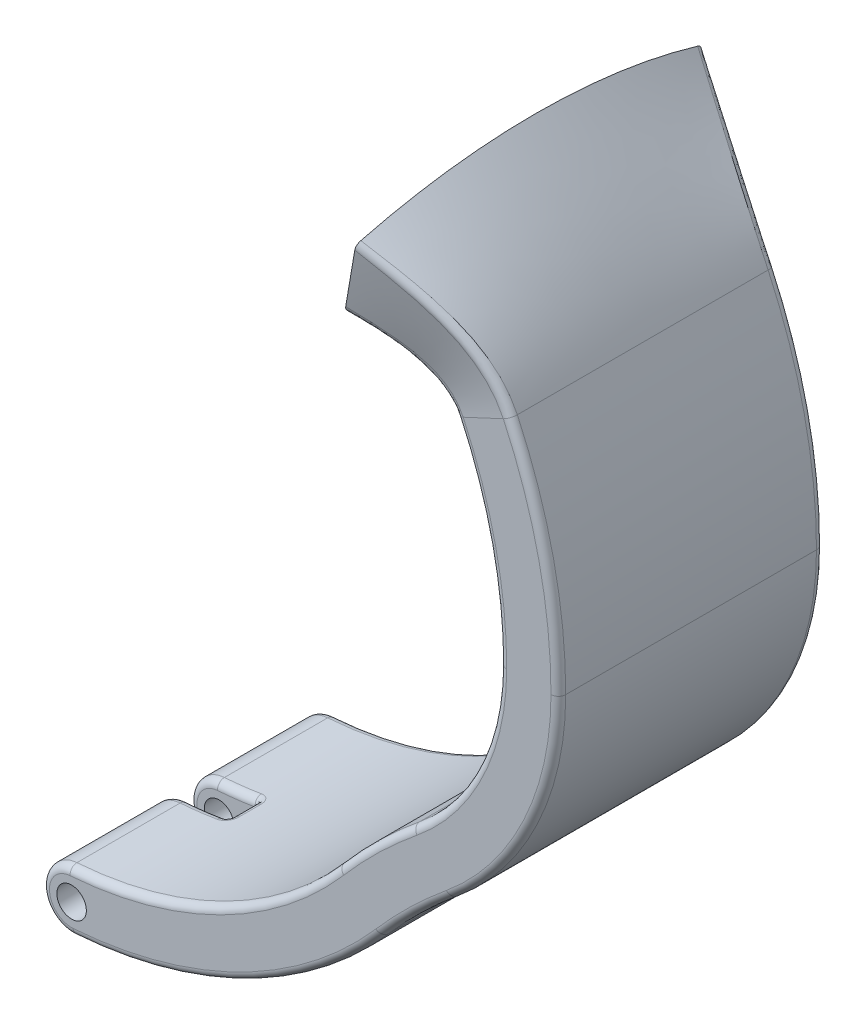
ISO-10303-21;
HEADER;
FILE_DESCRIPTION(('STEP AP214'),'2;1');
FILE_NAME('part.step','',(''),(''),'','','');
FILE_SCHEMA(('AUTOMOTIVE_DESIGN { 1 0 10303 214 1 1 1 1 }'));
ENDSEC;
DATA;
#1=APPLICATION_CONTEXT('core data for automotive mechanical design processes');
#2=APPLICATION_PROTOCOL_DEFINITION('international standard','automotive_design',2000,#1);
#3=PRODUCT_CONTEXT('',#1,'mechanical');
#4=PRODUCT('Part','Part','',(#3));
#5=PRODUCT_RELATED_PRODUCT_CATEGORY('part','',(#4));
#6=PRODUCT_DEFINITION_FORMATION('','',#4);
#7=PRODUCT_DEFINITION_CONTEXT('part definition',#1,'design');
#8=PRODUCT_DEFINITION('design','',#6,#7);
#9=PRODUCT_DEFINITION_SHAPE('','',#8);
#10=(LENGTH_UNIT() NAMED_UNIT(*) SI_UNIT(.MILLI.,.METRE.));
#11=(NAMED_UNIT(*) PLANE_ANGLE_UNIT() SI_UNIT($,.RADIAN.));
#12=(NAMED_UNIT(*) SI_UNIT($,.STERADIAN.) SOLID_ANGLE_UNIT());
#13=UNCERTAINTY_MEASURE_WITH_UNIT(LENGTH_MEASURE(1.E-05),#10,'distance_accuracy_value','');
#14=(GEOMETRIC_REPRESENTATION_CONTEXT(3) GLOBAL_UNCERTAINTY_ASSIGNED_CONTEXT((#13)) GLOBAL_UNIT_ASSIGNED_CONTEXT((#10,
#11,#12)) REPRESENTATION_CONTEXT('',''));
#15=CARTESIAN_POINT('',(0.,0.,0.));
#16=DIRECTION('',(0.,0.,1.));
#17=DIRECTION('',(1.,0.,0.));
#18=AXIS2_PLACEMENT_3D('',#15,#16,#17);
#19=CARTESIAN_POINT('',(2.92370294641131E-10,-21.,9.));
#20=DIRECTION('',(0.,0.,-1.));
#21=DIRECTION('',(-1.,0.,0.));
#22=AXIS2_PLACEMENT_3D('',#19,#20,#21);
#23=CYLINDRICAL_SURFACE('',#22,26.5);
#24=DIRECTION('',(0.,0.,-1.));
#25=VECTOR('',#24,1.);
#26=CARTESIAN_POINT('',(1.85964912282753,-47.4346686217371,9.));
#27=LINE('',#26,#25);
#28=CARTESIAN_POINT('',(1.85964912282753,-47.4346686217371,-1.49999999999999));
#29=VERTEX_POINT('',#28);
#30=CARTESIAN_POINT('',(1.85964912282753,-47.4346686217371,-8.5));
#31=VERTEX_POINT('',#30);
#32=EDGE_CURVE('E1007',#29,#31,#27,.T.);
#33=ORIENTED_EDGE('',*,*,#32,.F.);
#34=CARTESIAN_POINT('',(2.92370294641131E-10,-21.,-1.49999999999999));
#35=DIRECTION('',(0.,0.,1.));
#36=DIRECTION('',(1.,0.,0.));
#37=AXIS2_PLACEMENT_3D('',#34,#35,#36);
#38=CIRCLE('',#37,26.5);
#39=CARTESIAN_POINT('',(4.36759259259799,-47.1376000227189,-1.49999999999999));
#40=VERTEX_POINT('',#39);
#41=EDGE_CURVE('E1352',#29,#40,#38,.T.);
#42=ORIENTED_EDGE('',*,*,#41,.T.);
#43=CARTESIAN_POINT('',(5.06335076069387,-47.0117757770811,-0.505089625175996));
#44=CARTESIAN_POINT('',(4.67766637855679,-47.0868515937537,-0.643387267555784));
#45=CARTESIAN_POINT('',(4.68629522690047,-47.5025639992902,-0.668363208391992));
#46=CARTESIAN_POINT('',(5.07670257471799,-47.0091739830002,-0.544346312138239));
#47=CARTESIAN_POINT('',(4.68499820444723,-47.0856296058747,-0.65997410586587));
#48=CARTESIAN_POINT('',(4.69082980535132,-47.4999131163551,-0.681448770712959));
#49=CARTESIAN_POINT('',(5.08679248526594,-47.0072018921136,-0.5847871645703));
#50=CARTESIAN_POINT('',(4.69058412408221,-47.0846968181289,-0.677477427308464));
#51=CARTESIAN_POINT('',(4.69425656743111,-47.4979038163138,-0.694929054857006));
#52=CARTESIAN_POINT('',(5.10028896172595,-47.0045599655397,-0.666818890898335));
#53=CARTESIAN_POINT('',(4.69807552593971,-47.083444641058,-0.713306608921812));
#54=CARTESIAN_POINT('',(4.69884027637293,-47.4952120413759,-0.722272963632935));
#55=CARTESIAN_POINT('',(5.10370122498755,-47.0038890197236,-0.708408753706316));
#56=CARTESIAN_POINT('',(4.69999656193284,-47.083122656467,-0.731660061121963));
#57=CARTESIAN_POINT('',(4.69999915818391,-47.4945284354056,-0.736136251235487));
#58=CARTESIAN_POINT('',(5.10370618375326,-47.0038876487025,-0.791613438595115));
#59=CARTESIAN_POINT('',(4.70000343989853,-47.0831213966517,-0.768349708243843));
#60=CARTESIAN_POINT('',(4.70000084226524,-47.494527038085,-0.76387114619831));
#61=CARTESIAN_POINT('',(5.10029523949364,-47.0045579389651,-0.83322826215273));
#62=CARTESIAN_POINT('',(4.69808724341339,-47.0834424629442,-0.786717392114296));
#63=CARTESIAN_POINT('',(4.69884240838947,-47.4952099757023,-0.777742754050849));
#64=CARTESIAN_POINT('',(5.08677172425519,-47.0072067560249,-0.915253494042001));
#65=CARTESIAN_POINT('',(4.69056430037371,-47.0847003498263,-0.8225369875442));
#66=CARTESIAN_POINT('',(4.69424951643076,-47.4979087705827,-0.805084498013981));
#67=CARTESIAN_POINT('',(5.07666057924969,-47.0091850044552,-0.955664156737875));
#68=CARTESIAN_POINT('',(4.68494575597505,-47.0856391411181,-0.84001760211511));
#69=CARTESIAN_POINT('',(4.69081554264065,-47.4999243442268,-0.818554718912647));
#70=CARTESIAN_POINT('',(5.05005443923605,-47.0143639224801,-1.03411679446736));
#71=CARTESIAN_POINT('',(4.67037015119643,-47.0880668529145,-0.873246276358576));
#72=CARTESIAN_POINT('',(4.68177949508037,-47.5052009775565,-0.844705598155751));
#73=CARTESIAN_POINT('',(5.03356592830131,-47.0175633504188,-1.07216112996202));
#74=CARTESIAN_POINT('',(4.66139383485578,-47.0895589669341,-0.889016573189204));
#75=CARTESIAN_POINT('',(4.67617962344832,-47.5084607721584,-0.857387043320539));
#76=CARTESIAN_POINT('',(4.99472548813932,-47.02504776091,-1.14490373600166));
#77=CARTESIAN_POINT('',(4.64064628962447,-47.0929949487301,-0.918200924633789));
#78=CARTESIAN_POINT('',(4.66298853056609,-47.5160863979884,-0.881634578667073));
#79=CARTESIAN_POINT('',(4.9723652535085,-47.0293342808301,-1.179597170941));
#80=CARTESIAN_POINT('',(4.62884310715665,-47.0949440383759,-0.931620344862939));
#81=CARTESIAN_POINT('',(4.65539448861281,-47.5204537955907,-0.893199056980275));
#82=CARTESIAN_POINT('',(4.8970055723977,-47.0436545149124,-1.27764908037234));
#83=CARTESIAN_POINT('',(4.58990792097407,-47.1013449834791,-0.967762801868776));
#84=CARTESIAN_POINT('',(4.6298006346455,-47.5350442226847,-0.92588302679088));
#85=CARTESIAN_POINT('',(4.83586373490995,-47.0551215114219,-1.33458689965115));
#86=CARTESIAN_POINT('',(4.55939063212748,-47.106326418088,-0.98594838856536));
#87=CARTESIAN_POINT('',(4.60903548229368,-47.54672757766,-0.944862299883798));
#88=CARTESIAN_POINT('',(4.69787774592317,-47.0803536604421,-1.42557963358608));
#89=CARTESIAN_POINT('',(4.49561471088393,-47.1166818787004,-1.00898255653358));
#90=CARTESIAN_POINT('',(4.56217231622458,-47.5724358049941,-0.975193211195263));
#91=CARTESIAN_POINT('',(4.62078132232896,-47.0941549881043,-1.45922360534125));
#92=CARTESIAN_POINT('',(4.46220203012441,-47.122079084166,-1.01338660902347));
#93=CARTESIAN_POINT('',(4.53598862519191,-47.5864975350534,-0.986407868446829));
#94=CARTESIAN_POINT('',(4.48394920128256,-47.1179547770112,-1.4929578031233));
#95=CARTESIAN_POINT('',(4.40851822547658,-47.1308259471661,-1.0106795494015));
#96=CARTESIAN_POINT('',(4.48951733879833,-47.6107463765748,-0.997652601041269));
#97=CARTESIAN_POINT('',(4.42576930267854,-47.1278789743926,-1.50000278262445));
#98=CARTESIAN_POINT('',(4.38719636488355,-47.1343240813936,-1.00647040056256));
#99=CARTESIAN_POINT('',(4.4697581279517,-47.6208578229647,-1.00000092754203));
#100=CARTESIAN_POINT('',(4.32596957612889,-47.144555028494,-1.49999800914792));
#101=CARTESIAN_POINT('',(4.35340948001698,-47.139970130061,-0.995318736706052));
#102=CARTESIAN_POINT('',(4.43586388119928,-47.6378485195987,-0.999999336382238));
#103=CARTESIAN_POINT('',(4.28434819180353,-47.1514060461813,-1.49638840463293));
#104=CARTESIAN_POINT('',(4.34013124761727,-47.1422230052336,-0.989455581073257));
#105=CARTESIAN_POINT('',(4.42172831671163,-47.6448288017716,-0.998796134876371));
#106=CARTESIAN_POINT('',(4.20208826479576,-47.1647520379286,-1.48204563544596));
#107=CARTESIAN_POINT('',(4.31540198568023,-47.1465063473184,-0.975888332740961));
#108=CARTESIAN_POINT('',(4.39379098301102,-47.6584266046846,-0.994015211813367));
#109=CARTESIAN_POINT('',(4.16145385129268,-47.1712456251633,-1.47128658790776));
#110=CARTESIAN_POINT('',(4.30398341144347,-47.1485323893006,-0.968165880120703));
#111=CARTESIAN_POINT('',(4.37999061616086,-47.6650427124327,-0.990428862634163));
#112=CARTESIAN_POINT('',(4.12196041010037,-47.1774605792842,-1.45701241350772));
#113=CARTESIAN_POINT('',(4.29368117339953,-47.150421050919,-0.95986702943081));
#114=CARTESIAN_POINT('',(4.36657774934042,-47.6713749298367,-0.985670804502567));
#115=(BOUNDED_SURFACE() B_SPLINE_SURFACE(3,2,((#43,#44,#45),(#46,#47,#48),(#49,#50,#51),(#52,
#53,#54),(#55,#56,#57),(#58,#59,#60),(#61,#62,#63),(#64,#65,#66),(#67,#68,#69),(#70,#71,#72),
(#73,#74,#75),(#76,#77,#78),(#79,#80,#81),(#82,#83,#84),(#85,#86,#87),(#88,#89,#90),(#91,#92,
#93),(#94,#95,#96),(#97,#98,#99),(#100,#101,#102),(#103,#104,#105),(#106,#107,#108),(#109,#110,
#111),(#112,#113,#114)),.UNSPECIFIED.,.F.,.F.,.F.) B_SPLINE_SURFACE_WITH_KNOTS((4,2,2,2,2,2,2,2,
2,2,2,4),(3,3),(0.,0.124733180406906,0.249359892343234,0.374053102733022,0.498719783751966,
0.623260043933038,0.747977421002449,0.99860383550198,1.25354619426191,1.43357246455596,
1.56237377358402,1.69164393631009),(0.,1.),
.UNSPECIFIED.) GEOMETRIC_REPRESENTATION_ITEM() RATIONAL_B_SPLINE_SURFACE(((1.,0.768308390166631,
1.),(1.,0.769592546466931,1.),(1.,0.770566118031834,1.),(1.,0.77187051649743,1.),(1.,
0.772201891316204,1.),(1.,0.772202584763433,1.),(1.,0.771871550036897,1.),(1.,0.770563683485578,
1.),(1.,0.769586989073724,1.),(1.,0.767031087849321,1.),(1.,0.765452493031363,1.),(1.,
0.761762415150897,1.),(1.,0.759650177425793,1.),(1.,0.75260143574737,1.),(1.,0.746966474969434,
1.),(1.,0.734634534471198,1.),(1.,0.72792093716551,1.),(1.,0.716458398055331,1.),(1.,
0.711711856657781,1.),(1.,0.703812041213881,1.),(1.,0.700589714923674,1.),(1.,0.694362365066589,
1.),(1.,0.691358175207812,1.),(1.,0.688511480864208,1.))) REPRESENTATION_ITEM('') SURFACE());
#116=CARTESIAN_POINT('',(4.12196041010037,-47.1774605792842,-1.45701241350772));
#117=CARTESIAN_POINT('',(4.16145385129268,-47.1712456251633,-1.47128658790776));
#118=CARTESIAN_POINT('',(4.20208826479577,-47.1647520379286,-1.48204563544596));
#119=CARTESIAN_POINT('',(4.28434819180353,-47.1514060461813,-1.49638840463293));
#120=CARTESIAN_POINT('',(4.32596957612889,-47.144555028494,-1.49999800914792));
#121=CARTESIAN_POINT('',(4.42576930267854,-47.1278789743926,-1.50000278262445));
#122=CARTESIAN_POINT('',(4.48394920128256,-47.1179547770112,-1.4929578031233));
#123=CARTESIAN_POINT('',(4.62078132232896,-47.0941549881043,-1.45922360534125));
#124=CARTESIAN_POINT('',(4.69787774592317,-47.0803536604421,-1.42557963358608));
#125=CARTESIAN_POINT('',(4.83586373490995,-47.0551215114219,-1.33458689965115));
#126=CARTESIAN_POINT('',(4.8970055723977,-47.0436545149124,-1.27764908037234));
#127=CARTESIAN_POINT('',(4.9723652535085,-47.02933428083,-1.179597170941));
#128=CARTESIAN_POINT('',(4.99472548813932,-47.02504776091,-1.14490373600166));
#129=CARTESIAN_POINT('',(5.03356592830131,-47.0175633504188,-1.07216112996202));
#130=CARTESIAN_POINT('',(5.05005443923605,-47.0143639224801,-1.03411679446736));
#131=CARTESIAN_POINT('',(5.07666057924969,-47.0091850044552,-0.955664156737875));
#132=CARTESIAN_POINT('',(5.08677172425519,-47.0072067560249,-0.915253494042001));
#133=CARTESIAN_POINT('',(5.10029523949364,-47.0045579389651,-0.83322826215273));
#134=CARTESIAN_POINT('',(5.10370618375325,-47.0038876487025,-0.791613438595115));
#135=CARTESIAN_POINT('',(5.10370122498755,-47.0038890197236,-0.708408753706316));
#136=CARTESIAN_POINT('',(5.10028896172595,-47.0045599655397,-0.666818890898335));
#137=CARTESIAN_POINT('',(5.08679248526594,-47.0072018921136,-0.5847871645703));
#138=CARTESIAN_POINT('',(5.07670257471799,-47.0091739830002,-0.544346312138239));
#139=CARTESIAN_POINT('',(5.06335076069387,-47.0117757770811,-0.505089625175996));
#140=B_SPLINE_CURVE_WITH_KNOTS('',3,(#116,#117,#118,#119,#120,#121,#122,#123,#124,#125,#126,
#127,#128,#129,#130,#131,#132,#133,#134,#135,#136,#137,#138,#139),.UNSPECIFIED.,.F.,.F.,(4,2,2,
2,2,2,2,2,2,2,2,4),(0.,0.129270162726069,0.258071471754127,0.438097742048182,0.693040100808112,
0.943666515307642,1.06838389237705,1.19292415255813,1.31759083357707,1.44228404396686,
1.56691075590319,1.69164393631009),.UNSPECIFIED.);
#141=CARTESIAN_POINT('',(5.10370370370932,-47.0038883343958,-0.750000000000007));
#142=VERTEX_POINT('',#141);
#143=EDGE_CURVE('E1365',#40,#142,#140,.T.);
#144=ORIENTED_EDGE('',*,*,#143,.T.);
#145=DIRECTION('',(0.,0.,-1.));
#146=VECTOR('',#145,1.);
#147=CARTESIAN_POINT('',(5.10370370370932,-47.0038883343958,9.));
#148=LINE('',#147,#146);
#149=CARTESIAN_POINT('',(5.10370370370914,-47.0038883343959,0.750000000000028));
#150=VERTEX_POINT('',#149);
#151=EDGE_CURVE('E1406',#142,#150,#148,.F.);
#152=ORIENTED_EDGE('',*,*,#151,.T.);
#153=CARTESIAN_POINT('',(4.12196041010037,-47.1774605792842,1.45701241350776));
#154=CARTESIAN_POINT('',(4.29368117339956,-47.150421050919,0.959867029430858));
#155=CARTESIAN_POINT('',(4.36657774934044,-47.6713749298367,0.985670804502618));
#156=CARTESIAN_POINT('',(4.16138830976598,-47.1712559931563,1.47126434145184));
#157=CARTESIAN_POINT('',(4.30396617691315,-47.1485353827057,0.968150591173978));
#158=CARTESIAN_POINT('',(4.37996835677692,-47.6650532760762,0.990421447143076));
#159=CARTESIAN_POINT('',(4.20196787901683,-47.1647712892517,1.48201401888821));
#160=CARTESIAN_POINT('',(4.31536832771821,-47.1465122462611,0.975864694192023));
#161=CARTESIAN_POINT('',(4.39375009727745,-47.6584462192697,0.99400467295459));
#162=CARTESIAN_POINT('',(4.28423375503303,-47.1514248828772,1.49637895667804));
#163=CARTESIAN_POINT('',(4.34009441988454,-47.1422293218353,0.989440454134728));
#164=CARTESIAN_POINT('',(4.42168945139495,-47.644847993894,0.998792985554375));
#165=CARTESIAN_POINT('',(4.32591916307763,-47.1445634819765,1.49999984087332));
#166=CARTESIAN_POINT('',(4.35339162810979,-47.1399732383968,0.995315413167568));
#167=CARTESIAN_POINT('',(4.43584675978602,-47.6378571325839,0.999999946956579));
#168=CARTESIAN_POINT('',(4.40953401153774,-47.1305917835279,1.50000016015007));
#169=CARTESIAN_POINT('',(4.38175172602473,-47.1352337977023,1.00467078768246));
#170=CARTESIAN_POINT('',(4.4642442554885,-47.6236218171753,1.00000005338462));
#171=CARTESIAN_POINT('',(4.45146329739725,-47.1234801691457,1.4963328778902));
#172=CARTESIAN_POINT('',(4.39680478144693,-47.1327518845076,1.0081567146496));
#173=CARTESIAN_POINT('',(4.47848439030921,-47.6163760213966,0.998777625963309));
#174=CARTESIAN_POINT('',(4.53406109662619,-47.1092715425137,1.48182241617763));
#175=CARTESIAN_POINT('',(4.42804474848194,-47.1276392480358,1.01215541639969));
#176=CARTESIAN_POINT('',(4.50653647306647,-47.6018993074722,0.99394080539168));
#177=CARTESIAN_POINT('',(4.574729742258,-47.1021745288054,1.47097999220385));
#178=CARTESIAN_POINT('',(4.44421950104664,-47.1250101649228,1.01269630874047));
#179=CARTESIAN_POINT('',(4.52034846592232,-47.5946683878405,0.990326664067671));
#180=CARTESIAN_POINT('',(4.69311944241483,-47.0812371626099,1.42802749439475));
#181=CARTESIAN_POINT('',(4.49326904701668,-47.1170511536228,1.00919942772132));
#182=CARTESIAN_POINT('',(4.56055628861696,-47.5733359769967,0.976009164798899));
#183=CARTESIAN_POINT('',(4.76752129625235,-47.0677005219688,1.38548987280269));
#184=CARTESIAN_POINT('',(4.52721372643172,-47.111560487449,1.00023222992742));
#185=CARTESIAN_POINT('',(4.58582484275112,-47.5595439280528,0.961829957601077));
#186=CARTESIAN_POINT('',(4.89784279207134,-47.0435337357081,1.27718339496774));
#187=CARTESIAN_POINT('',(4.58995279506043,-47.1013398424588,0.967666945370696));
#188=CARTESIAN_POINT('',(4.63008497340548,-47.5349211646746,0.92572779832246));
#189=CARTESIAN_POINT('',(4.95384439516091,-47.0328907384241,1.2115203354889));
#190=CARTESIAN_POINT('',(4.61895599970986,-47.0965774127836,0.944306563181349));
#191=CARTESIAN_POINT('',(4.64910438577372,-47.5240773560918,0.903840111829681));
#192=CARTESIAN_POINT('',(5.01891688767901,-47.0203948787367,1.10204447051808));
#193=CARTESIAN_POINT('',(4.65350107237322,-47.0908686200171,0.901196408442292));
#194=CARTESIAN_POINT('',(4.67120447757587,-47.5113457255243,0.867348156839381));
#195=CARTESIAN_POINT('',(5.03740266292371,-47.0168179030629,1.0639582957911));
#196=CARTESIAN_POINT('',(4.66349539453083,-47.0892096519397,0.885637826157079));
#197=CARTESIAN_POINT('',(4.67748266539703,-47.5077012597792,0.854652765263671));
#198=CARTESIAN_POINT('',(5.06783465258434,-47.0109071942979,0.985092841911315));
#199=CARTESIAN_POINT('',(4.68007792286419,-47.0864509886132,0.852601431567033));
#200=CARTESIAN_POINT('',(4.68781805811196,-47.5016790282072,0.82836428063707));
#201=CARTESIAN_POINT('',(5.07978893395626,-47.0085719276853,0.94431695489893));
#202=CARTESIAN_POINT('',(4.68669624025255,-47.0853463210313,0.835107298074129));
#203=CARTESIAN_POINT('',(4.69187800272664,-47.4992996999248,0.814772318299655));
#204=CARTESIAN_POINT('',(5.09851582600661,-47.0049082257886,0.852588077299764));
#205=CARTESIAN_POINT('',(4.69708053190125,-47.0836113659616,0.795267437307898));
#206=CARTESIAN_POINT('',(4.69823807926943,-47.4955668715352,0.78419602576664));
#207=CARTESIAN_POINT('',(5.10370284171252,-47.0038884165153,0.801276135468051));
#208=CARTESIAN_POINT('',(4.70000038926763,-47.0831219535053,0.772610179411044));
#209=CARTESIAN_POINT('',(4.69999970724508,-47.4945278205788,0.767092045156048));
#210=CARTESIAN_POINT('',(5.10370440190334,-47.0038882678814,0.70846770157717));
#211=CARTESIAN_POINT('',(4.69999968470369,-47.0831220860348,0.731686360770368));
#212=CARTESIAN_POINT('',(4.70000023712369,-47.4945276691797,0.736155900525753));
#213=CARTESIAN_POINT('',(5.10030268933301,-47.0045572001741,0.66695889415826));
#214=CARTESIAN_POINT('',(4.69808395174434,-47.0834432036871,0.713368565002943));
#215=CARTESIAN_POINT('',(4.69884493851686,-47.4952092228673,0.722319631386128));
#216=CARTESIAN_POINT('',(5.08682668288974,-47.0071952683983,0.584937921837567));
#217=CARTESIAN_POINT('',(4.69060239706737,-47.0846937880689,0.67754247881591));
#218=CARTESIAN_POINT('',(4.69426818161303,-47.4978970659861,0.694979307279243));
#219=CARTESIAN_POINT('',(5.07672312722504,-47.0091701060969,0.544430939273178));
#220=CARTESIAN_POINT('',(4.68500812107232,-47.0856280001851,0.660009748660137));
#221=CARTESIAN_POINT('',(4.690836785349,-47.4999091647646,0.68147697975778));
#222=CARTESIAN_POINT('',(5.06335076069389,-47.0117757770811,0.505089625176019));
#223=CARTESIAN_POINT('',(4.67766637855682,-47.0868515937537,0.643387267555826));
#224=CARTESIAN_POINT('',(4.6862952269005,-47.5025639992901,0.668363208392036));
#225=(BOUNDED_SURFACE() B_SPLINE_SURFACE(3,2,((#153,#154,#155),(#156,#157,#158),(#159,#160,
#161),(#162,#163,#164),(#165,#166,#167),(#168,#169,#170),(#171,#172,#173),(#174,#175,#176),
(#177,#178,#179),(#180,#181,#182),(#183,#184,#185),(#186,#187,#188),(#189,#190,#191),(#192,#193,
#194),(#195,#196,#197),(#198,#199,#200),(#201,#202,#203),(#204,#205,#206),(#207,#208,#209),
(#210,#211,#212),(#213,#214,#215),(#216,#217,#218),(#219,#220,#221),(#222,#223,#224)),
.UNSPECIFIED.,.F.,.F.,.F.) B_SPLINE_SURFACE_WITH_KNOTS((4,2,2,2,2,2,2,2,2,2,2,4),(3,3),(0.,
0.129086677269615,0.258071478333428,0.387885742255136,0.517686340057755,0.776411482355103,
1.03396803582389,1.16137003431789,1.28861432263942,1.44220772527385,1.56661427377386,
1.69156761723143),(0.,1.),
.UNSPECIFIED.) GEOMETRIC_REPRESENTATION_ITEM() RATIONAL_B_SPLINE_SURFACE(((1.,0.688511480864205,
1.),(1.,0.691353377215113,1.),(1.,0.694353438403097,1.),(1.,0.700580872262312,1.),(1.,
0.703808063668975,1.),(1.,0.710426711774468,1.),(1.,0.713819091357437,1.),(1.,0.720634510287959,
1.),(1.,0.724057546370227,1.),(1.,0.734197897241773,1.),(1.,0.740810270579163,1.),(1.,
0.752656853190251,1.),(1.,0.757897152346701,1.),(1.,0.764056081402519,1.),(1.,0.765820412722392,
1.),(1.,0.768736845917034,1.),(1.,0.769889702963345,1.),(1.,0.771698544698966,1.),(1.,
0.772202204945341,1.),(1.,0.772202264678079,1.),(1.,0.771871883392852,1.),(1.,0.770569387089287,
1.),(1.,0.769594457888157,1.),(1.,0.76830839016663,1.))) REPRESENTATION_ITEM('') SURFACE());
#226=CARTESIAN_POINT('',(5.06335076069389,-47.0117757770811,0.505089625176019));
#227=CARTESIAN_POINT('',(5.07672312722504,-47.0091701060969,0.544430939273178));
#228=CARTESIAN_POINT('',(5.08682668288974,-47.0071952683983,0.584937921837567));
#229=CARTESIAN_POINT('',(5.10030268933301,-47.0045572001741,0.66695889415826));
#230=CARTESIAN_POINT('',(5.10370440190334,-47.0038882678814,0.70846770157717));
#231=CARTESIAN_POINT('',(5.10370284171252,-47.0038884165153,0.80127613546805));
#232=CARTESIAN_POINT('',(5.09851582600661,-47.0049082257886,0.852588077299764));
#233=CARTESIAN_POINT('',(5.07978893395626,-47.0085719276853,0.94431695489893));
#234=CARTESIAN_POINT('',(5.06783465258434,-47.0109071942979,0.985092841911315));
#235=CARTESIAN_POINT('',(5.03740266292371,-47.0168179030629,1.0639582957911));
#236=CARTESIAN_POINT('',(5.01891688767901,-47.0203948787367,1.10204447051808));
#237=CARTESIAN_POINT('',(4.95384439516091,-47.0328907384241,1.2115203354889));
#238=CARTESIAN_POINT('',(4.89784279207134,-47.0435337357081,1.27718339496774));
#239=CARTESIAN_POINT('',(4.76752129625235,-47.0677005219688,1.38548987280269));
#240=CARTESIAN_POINT('',(4.69311944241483,-47.0812371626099,1.42802749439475));
#241=CARTESIAN_POINT('',(4.574729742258,-47.1021745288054,1.47097999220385));
#242=CARTESIAN_POINT('',(4.53406109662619,-47.1092715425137,1.48182241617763));
#243=CARTESIAN_POINT('',(4.45146329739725,-47.1234801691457,1.4963328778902));
#244=CARTESIAN_POINT('',(4.40953401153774,-47.1305917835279,1.50000016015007));
#245=CARTESIAN_POINT('',(4.32591916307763,-47.1445634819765,1.49999984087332));
#246=CARTESIAN_POINT('',(4.28423375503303,-47.1514248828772,1.49637895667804));
#247=CARTESIAN_POINT('',(4.20196787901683,-47.1647712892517,1.48201401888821));
#248=CARTESIAN_POINT('',(4.16138830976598,-47.1712559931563,1.47126434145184));
#249=CARTESIAN_POINT('',(4.12196041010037,-47.1774605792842,1.45701241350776));
#250=B_SPLINE_CURVE_WITH_KNOTS('',3,(#226,#227,#228,#229,#230,#231,#232,#233,#234,#235,#236,
#237,#238,#239,#240,#241,#242,#243,#244,#245,#246,#247,#248,#249),.UNSPECIFIED.,.F.,.F.,(4,2,2,
2,2,2,2,2,2,2,2,4),(0.,0.124953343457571,0.249359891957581,0.402953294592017,0.530197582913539,
0.657599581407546,0.915156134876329,1.17388127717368,1.3036818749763,1.433496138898,
1.56248093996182,1.69156761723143),.UNSPECIFIED.);
#251=CARTESIAN_POINT('',(4.36759259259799,-47.1376000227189,1.50000000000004));
#252=VERTEX_POINT('',#251);
#253=EDGE_CURVE('E1397',#150,#252,#250,.T.);
#254=ORIENTED_EDGE('',*,*,#253,.T.);
#255=CARTESIAN_POINT('',(2.92370294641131E-10,-21.,1.49999999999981));
#256=DIRECTION('',(0.,0.,-1.));
#257=DIRECTION('',(-1.,0.,0.));
#258=AXIS2_PLACEMENT_3D('',#255,#256,#257);
#259=CIRCLE('',#258,26.5);
#260=CARTESIAN_POINT('',(1.85964912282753,-47.4346686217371,1.49999999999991));
#261=VERTEX_POINT('',#260);
#262=EDGE_CURVE('E1401',#252,#261,#259,.T.);
#263=ORIENTED_EDGE('',*,*,#262,.T.);
#264=CARTESIAN_POINT('',(1.85964912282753,-47.4346686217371,8.5));
#265=VERTEX_POINT('',#264);
#266=EDGE_CURVE('E1014',#265,#261,#27,.T.);
#267=ORIENTED_EDGE('',*,*,#266,.F.);
#268=CARTESIAN_POINT('',(2.92370294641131E-10,-21.,8.5));
#269=DIRECTION('',(0.,0.,1.));
#270=DIRECTION('',(1.,0.,0.));
#271=AXIS2_PLACEMENT_3D('',#268,#269,#270);
#272=CIRCLE('',#271,26.5);
#273=CARTESIAN_POINT('',(20.0742481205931,-38.299553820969,8.5));
#274=VERTEX_POINT('',#273);
#275=EDGE_CURVE('E1092',#265,#274,#272,.T.);
#276=ORIENTED_EDGE('',*,*,#275,.T.);
#277=DIRECTION('',(0.,0.,-1.));
#278=VECTOR('',#277,1.);
#279=CARTESIAN_POINT('',(20.0742481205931,-38.299553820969,9.));
#280=LINE('',#279,#278);
#281=CARTESIAN_POINT('',(20.0742481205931,-38.299553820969,-8.5));
#282=VERTEX_POINT('',#281);
#283=EDGE_CURVE('E1035',#274,#282,#280,.T.);
#284=ORIENTED_EDGE('',*,*,#283,.T.);
#285=CARTESIAN_POINT('',(2.92370294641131E-10,-21.,-8.5));
#286=DIRECTION('',(0.,0.,1.));
#287=DIRECTION('',(1.,0.,0.));
#288=AXIS2_PLACEMENT_3D('',#285,#286,#287);
#289=CIRCLE('',#288,26.5);
#290=EDGE_CURVE('E1094',#282,#31,#289,.F.);
#291=ORIENTED_EDGE('',*,*,#290,.T.);
#292=EDGE_LOOP('',(#33,#42,#144,#152,#254,#263,#267,#276,#284,#291));
#293=FACE_BOUND('',#292,.T.);
#294=ADVANCED_FACE('F640',(#293),#23,.F.);
#295=CARTESIAN_POINT('',(2.92370294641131E-10,-21.,9.));
#296=DIRECTION('',(0.,0.,-1.));
#297=DIRECTION('',(-1.,0.,0.));
#298=AXIS2_PLACEMENT_3D('',#295,#296,#297);
#299=CYLINDRICAL_SURFACE('',#298,30.5);
#300=CARTESIAN_POINT('',(4.68622155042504,-50.5531416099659,-0.668150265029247));
#301=CARTESIAN_POINT('',(4.69722539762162,-51.1412486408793,-0.699907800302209));
#302=CARTESIAN_POINT('',(5.24464239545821,-51.045693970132,-0.504450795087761));
#303=CARTESIAN_POINT('',(4.6907811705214,-50.5507513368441,-0.68127059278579));
#304=CARTESIAN_POINT('',(4.69827848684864,-51.1413281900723,-0.708814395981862));
#305=CARTESIAN_POINT('',(5.25854923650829,-51.0432638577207,-0.543811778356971));
#306=CARTESIAN_POINT('',(4.69422633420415,-50.5489398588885,-0.694786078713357));
#307=CARTESIAN_POINT('',(4.69897371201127,-51.1414105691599,-0.717293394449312));
#308=CARTESIAN_POINT('',(5.2690569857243,-51.0414221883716,-0.58435823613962));
#309=CARTESIAN_POINT('',(4.69883438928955,-50.5465132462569,-0.722201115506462));
#310=CARTESIAN_POINT('',(4.69983692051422,-51.1415361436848,-0.733858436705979));
#311=CARTESIAN_POINT('',(5.28311155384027,-51.0389551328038,-0.666603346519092));
#312=CARTESIAN_POINT('',(4.69999917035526,-50.5458971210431,-0.736100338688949));
#313=CARTESIAN_POINT('',(4.70000325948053,-51.1415791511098,-0.741926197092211));
#314=CARTESIAN_POINT('',(5.28666413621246,-51.0383287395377,-0.708301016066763));
#315=CARTESIAN_POINT('',(4.70000083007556,-50.5458958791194,-0.76390687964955));
#316=CARTESIAN_POINT('',(4.69999673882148,-51.1415806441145,-0.758078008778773));
#317=CARTESIAN_POINT('',(5.2866691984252,-51.0383274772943,-0.791720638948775));
#318=CARTESIAN_POINT('',(4.69883649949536,-50.5465114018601,-0.777814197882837));
#319=CARTESIAN_POINT('',(4.69982370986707,-51.1415390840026,-0.766143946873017));
#320=CARTESIAN_POINT('',(5.28311799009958,-51.0389532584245,-0.833442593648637));
#321=CARTESIAN_POINT('',(4.69421941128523,-50.5489442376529,-0.805227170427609));
#322=CARTESIAN_POINT('',(4.69898603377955,-51.1414074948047,-0.782721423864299));
#323=CARTESIAN_POINT('',(5.26903587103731,-51.0414266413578,-0.915681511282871));
#324=CARTESIAN_POINT('',(4.69076713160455,-50.5507612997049,-0.818732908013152));
#325=CARTESIAN_POINT('',(4.69832347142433,-51.1413177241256,-0.791214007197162));
#326=CARTESIAN_POINT('',(5.25850641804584,-51.0432739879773,-0.956198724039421));
#327=CARTESIAN_POINT('',(4.68168021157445,-50.5555196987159,-0.844954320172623));
#328=CARTESIAN_POINT('',(4.69613299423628,-51.1411799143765,-0.808924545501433));
#329=CARTESIAN_POINT('',(5.23079131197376,-51.0481116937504,-1.03486296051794));
#330=CARTESIAN_POINT('',(4.6760476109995,-50.5584599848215,-0.857670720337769));
#331=CARTESIAN_POINT('',(4.69461167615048,-51.1411317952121,-0.818121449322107));
#332=CARTESIAN_POINT('',(5.21361188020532,-51.0511009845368,-1.07301216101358));
#333=CARTESIAN_POINT('',(4.66277579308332,-50.5653400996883,-0.88198324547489));
#334=CARTESIAN_POINT('',(4.69021607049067,-51.1411962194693,-0.837262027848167));
#335=CARTESIAN_POINT('',(5.17313283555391,-51.058095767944,-1.14594973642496));
#336=CARTESIAN_POINT('',(4.65513375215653,-50.5692813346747,-0.893577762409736));
#337=CARTESIAN_POINT('',(4.68735149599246,-51.1413079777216,-0.847186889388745));
#338=CARTESIAN_POINT('',(5.14982461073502,-51.0621026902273,-1.18073328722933));
#339=CARTESIAN_POINT('',(4.62939972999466,-50.5824370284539,-0.926301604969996));
#340=CARTESIAN_POINT('',(4.675912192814,-51.1420808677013,-0.877802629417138));
#341=CARTESIAN_POINT('',(5.07133584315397,-51.0754776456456,-1.2789048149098));
#342=CARTESIAN_POINT('',(4.60852984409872,-50.5929672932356,-0.945286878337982));
#343=CARTESIAN_POINT('',(4.66452402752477,-51.1431719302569,-0.899400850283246));
#344=CARTESIAN_POINT('',(5.00768269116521,-51.0861834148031,-1.3358606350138));
#345=CARTESIAN_POINT('',(4.56150270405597,-50.6161029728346,-0.975524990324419));
#346=CARTESIAN_POINT('',(4.63141862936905,-51.1471894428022,-0.940435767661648));
#347=CARTESIAN_POINT('',(4.86424991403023,-51.1097046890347,-1.42657497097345));
#348=CARTESIAN_POINT('',(4.53527593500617,-50.6287352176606,-0.986666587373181));
#349=CARTESIAN_POINT('',(4.60977054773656,-51.1501050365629,-0.959850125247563));
#350=CARTESIAN_POINT('',(4.78425826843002,-51.122547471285,-1.45999976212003));
#351=CARTESIAN_POINT('',(4.48900844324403,-50.6503907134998,-0.997713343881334));
#352=CARTESIAN_POINT('',(4.56569459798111,-51.1564138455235,-0.985627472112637));
#353=CARTESIAN_POINT('',(4.64314241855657,-51.1445638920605,-1.4931400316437));
#354=CARTESIAN_POINT('',(4.46950305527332,-50.6593469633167,-1.0000011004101));
#355=CARTESIAN_POINT('',(4.54562946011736,-51.1593720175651,-0.994183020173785));
#356=CARTESIAN_POINT('',(4.5836509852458,-51.1536694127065,-1.5000033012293));
#357=CARTESIAN_POINT('',(4.43588425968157,-50.6744741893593,-0.999999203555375));
#358=CARTESIAN_POINT('',(4.5087867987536,-51.1648982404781,-1.0041683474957));
#359=CARTESIAN_POINT('',(4.48111365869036,-51.1690487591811,-1.49999761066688));
#360=CARTESIAN_POINT('',(4.42176974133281,-50.6807311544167,-0.998799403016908));
#361=CARTESIAN_POINT('',(4.49267725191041,-51.1673410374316,-1.00693396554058));
#362=CARTESIAN_POINT('',(4.43806437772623,-51.1754100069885,-1.49639820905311));
#363=CARTESIAN_POINT('',(4.39387568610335,-50.6929203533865,-0.994033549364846));
#364=CARTESIAN_POINT('',(4.4597838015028,-51.1723634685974,-1.00928630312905));
#365=CARTESIAN_POINT('',(4.35298750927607,-51.187802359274,-1.4821006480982));
#366=CARTESIAN_POINT('',(4.38009758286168,-50.6988512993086,-0.990458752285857));
#367=CARTESIAN_POINT('',(4.44298954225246,-51.174944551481,-1.00888638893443));
#368=CARTESIAN_POINT('',(4.3109642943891,-51.1938321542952,-1.47137625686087));
#369=CARTESIAN_POINT('',(4.36670835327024,-50.7045274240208,-0.985716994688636));
#370=CARTESIAN_POINT('',(4.42616678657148,-51.1775393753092,-1.0067268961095));
#371=CARTESIAN_POINT('',(4.27012714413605,-51.1996028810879,-1.45715098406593));
#372=(BOUNDED_SURFACE() B_SPLINE_SURFACE(3,2,((#300,#301,#302),(#303,#304,#305),(#306,#307,
#308),(#309,#310,#311),(#312,#313,#314),(#315,#316,#317),(#318,#319,#320),(#321,#322,#323),
(#324,#325,#326),(#327,#328,#329),(#330,#331,#332),(#333,#334,#335),(#336,#337,#338),(#339,#340,
#341),(#342,#343,#344),(#345,#346,#347),(#348,#349,#350),(#351,#352,#353),(#354,#355,#356),
(#357,#358,#359),(#360,#361,#362),(#363,#364,#365),(#366,#367,#368),(#369,#370,#371)),
.UNSPECIFIED.,.F.,.F.,.F.) B_SPLINE_SURFACE_WITH_KNOTS((4,2,2,2,2,2,2,2,2,2,2,4),(3,3),(0.,
0.125053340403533,0.250003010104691,0.375017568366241,0.500006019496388,0.624877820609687,
0.749926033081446,1.00079088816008,1.25514557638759,1.43238225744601,1.56066097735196,
1.68941461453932),(0.,1.),
.UNSPECIFIED.) GEOMETRIC_REPRESENTATION_ITEM() RATIONAL_B_SPLINE_SURFACE(((1.,0.64711731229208,
1.),(1.,0.645735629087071,1.),(1.,0.644683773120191,1.),(1.,0.643271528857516,1.),(1.,
0.642910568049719,1.),(1.,0.642909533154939,1.),(1.,0.643269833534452,1.),(1.,0.644686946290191,
1.),(1.,0.645743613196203,1.),(1.,0.64848972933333,1.),(1.,0.650178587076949,1.),(1.,
0.654090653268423,1.),(1.,0.656314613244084,1.),(1.,0.663643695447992,1.),(1.,0.669396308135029,
1.),(1.,0.681602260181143,1.),(1.,0.688064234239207,1.),(1.,0.698724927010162,1.),(1.,
0.703015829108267,1.),(1.,0.710067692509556,1.),(1.,0.712923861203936,1.),(1.,0.718378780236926,
1.),(1.,0.720976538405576,1.),(1.,0.723410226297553,1.))) REPRESENTATION_ITEM('') SURFACE());
#373=CARTESIAN_POINT('',(5.24464239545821,-51.045693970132,-0.504450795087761));
#374=CARTESIAN_POINT('',(5.25854923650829,-51.0432638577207,-0.543811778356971));
#375=CARTESIAN_POINT('',(5.2690569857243,-51.0414221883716,-0.58435823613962));
#376=CARTESIAN_POINT('',(5.28311155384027,-51.0389551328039,-0.666603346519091));
#377=CARTESIAN_POINT('',(5.28666413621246,-51.0383287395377,-0.708301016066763));
#378=CARTESIAN_POINT('',(5.2866691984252,-51.0383274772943,-0.791720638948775));
#379=CARTESIAN_POINT('',(5.28311799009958,-51.0389532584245,-0.833442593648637));
#380=CARTESIAN_POINT('',(5.26903587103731,-51.0414266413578,-0.915681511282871));
#381=CARTESIAN_POINT('',(5.25850641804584,-51.0432739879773,-0.956198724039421));
#382=CARTESIAN_POINT('',(5.23079131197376,-51.0481116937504,-1.03486296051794));
#383=CARTESIAN_POINT('',(5.21361188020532,-51.0511009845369,-1.07301216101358));
#384=CARTESIAN_POINT('',(5.17313283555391,-51.058095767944,-1.14594973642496));
#385=CARTESIAN_POINT('',(5.14982461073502,-51.0621026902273,-1.18073328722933));
#386=CARTESIAN_POINT('',(5.07133584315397,-51.0754776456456,-1.2789048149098));
#387=CARTESIAN_POINT('',(5.00768269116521,-51.0861834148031,-1.3358606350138));
#388=CARTESIAN_POINT('',(4.86424991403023,-51.1097046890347,-1.42657497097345));
#389=CARTESIAN_POINT('',(4.78425826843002,-51.122547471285,-1.45999976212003));
#390=CARTESIAN_POINT('',(4.64314241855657,-51.1445638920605,-1.4931400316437));
#391=CARTESIAN_POINT('',(4.5836509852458,-51.1536694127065,-1.5000033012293));
#392=CARTESIAN_POINT('',(4.48111365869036,-51.1690487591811,-1.49999761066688));
#393=CARTESIAN_POINT('',(4.43806437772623,-51.1754100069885,-1.49639820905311));
#394=CARTESIAN_POINT('',(4.35298750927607,-51.187802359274,-1.4821006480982));
#395=CARTESIAN_POINT('',(4.3109642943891,-51.1938321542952,-1.47137625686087));
#396=CARTESIAN_POINT('',(4.27012714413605,-51.1996028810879,-1.45715098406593));
#397=B_SPLINE_CURVE_WITH_KNOTS('',3,(#373,#374,#375,#376,#377,#378,#379,#380,#381,#382,#383,
#384,#385,#386,#387,#388,#389,#390,#391,#392,#393,#394,#395,#396),.UNSPECIFIED.,.F.,.F.,(4,2,2,
2,2,2,2,2,2,2,2,4),(0.,0.125053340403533,0.250003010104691,0.375017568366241,0.500006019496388,
0.624877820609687,0.749926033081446,1.00079088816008,1.25514557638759,1.43238225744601,
1.56066097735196,1.68941461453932),.UNSPECIFIED.);
#398=CARTESIAN_POINT('',(5.286666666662,-51.0383281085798,-0.750000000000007));
#399=VERTEX_POINT('',#398);
#400=CARTESIAN_POINT('',(4.52416666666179,-51.1625913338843,-1.49999999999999));
#401=VERTEX_POINT('',#400);
#402=EDGE_CURVE('E1433',#399,#401,#397,.T.);
#403=ORIENTED_EDGE('',*,*,#402,.T.);
#404=CARTESIAN_POINT('',(2.92370294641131E-10,-21.,-1.49999999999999));
#405=DIRECTION('',(0.,0.,1.));
#406=DIRECTION('',(1.,0.,0.));
#407=AXIS2_PLACEMENT_3D('',#404,#405,#406);
#408=CIRCLE('',#407,30.5);
#409=CARTESIAN_POINT('',(2.14035087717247,-51.424807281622,-1.49999999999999));
#410=VERTEX_POINT('',#409);
#411=EDGE_CURVE('E1434',#401,#410,#408,.F.);
#412=ORIENTED_EDGE('',*,*,#411,.T.);
#413=DIRECTION('',(0.,0.,-1.));
#414=VECTOR('',#413,1.);
#415=CARTESIAN_POINT('',(2.14035087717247,-51.424807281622,9.));
#416=LINE('',#415,#414);
#417=CARTESIAN_POINT('',(2.14035087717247,-51.424807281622,-8.5));
#418=VERTEX_POINT('',#417);
#419=EDGE_CURVE('E1013',#410,#418,#416,.T.);
#420=ORIENTED_EDGE('',*,*,#419,.T.);
#421=CARTESIAN_POINT('',(2.92370294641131E-10,-21.,-8.5));
#422=DIRECTION('',(0.,0.,1.));
#423=DIRECTION('',(1.,0.,0.));
#424=AXIS2_PLACEMENT_3D('',#421,#422,#423);
#425=CIRCLE('',#424,30.5);
#426=CARTESIAN_POINT('',(23.0047872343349,-41.0257275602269,-8.5));
#427=VERTEX_POINT('',#426);
#428=EDGE_CURVE('E1104',#418,#427,#425,.T.);
#429=ORIENTED_EDGE('',*,*,#428,.T.);
#430=DIRECTION('',(0.,0.,-1.));
#431=VECTOR('',#430,1.);
#432=CARTESIAN_POINT('',(23.0047872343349,-41.0257275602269,9.));
#433=LINE('',#432,#431);
#434=CARTESIAN_POINT('',(23.0047872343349,-41.0257275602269,8.5));
#435=VERTEX_POINT('',#434);
#436=EDGE_CURVE('E1032',#427,#435,#433,.F.);
#437=ORIENTED_EDGE('',*,*,#436,.T.);
#438=CARTESIAN_POINT('',(2.92370294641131E-10,-21.,8.5));
#439=DIRECTION('',(0.,0.,1.));
#440=DIRECTION('',(1.,0.,0.));
#441=AXIS2_PLACEMENT_3D('',#438,#439,#440);
#442=CIRCLE('',#441,30.5);
#443=CARTESIAN_POINT('',(2.14035087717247,-51.424807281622,8.5));
#444=VERTEX_POINT('',#443);
#445=EDGE_CURVE('E1102',#435,#444,#442,.F.);
#446=ORIENTED_EDGE('',*,*,#445,.T.);
#447=CARTESIAN_POINT('',(2.14035087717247,-51.424807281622,1.49999999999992));
#448=VERTEX_POINT('',#447);
#449=EDGE_CURVE('E902',#444,#448,#416,.T.);
#450=ORIENTED_EDGE('',*,*,#449,.T.);
#451=CARTESIAN_POINT('',(2.92370294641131E-10,-21.,1.4999999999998));
#452=DIRECTION('',(0.,0.,-1.));
#453=DIRECTION('',(-1.,0.,0.));
#454=AXIS2_PLACEMENT_3D('',#451,#452,#453);
#455=CIRCLE('',#454,30.5);
#456=CARTESIAN_POINT('',(4.52416666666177,-51.1625913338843,1.50000000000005));
#457=VERTEX_POINT('',#456);
#458=EDGE_CURVE('E1189',#448,#457,#455,.F.);
#459=ORIENTED_EDGE('',*,*,#458,.T.);
#460=CARTESIAN_POINT('',(4.36670835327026,-50.7045274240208,0.985716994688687));
#461=CARTESIAN_POINT('',(4.4261667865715,-51.1775393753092,1.00672689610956));
#462=CARTESIAN_POINT('',(4.27012714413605,-51.1996028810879,1.45715098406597));
#463=CARTESIAN_POINT('',(4.38007517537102,-50.6988608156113,0.990451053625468));
#464=CARTESIAN_POINT('',(4.44296002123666,-51.1749492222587,1.00888459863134));
#465=CARTESIAN_POINT('',(4.31089595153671,-51.1938418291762,1.47135316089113));
#466=CARTESIAN_POINT('',(4.39383399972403,-50.692938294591,0.994022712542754));
#467=CARTESIAN_POINT('',(4.45973208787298,-51.1723714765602,1.00928579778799));
#468=CARTESIAN_POINT('',(4.35286036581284,-51.1878205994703,1.48206813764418));
#469=CARTESIAN_POINT('',(4.42172972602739,-50.6807489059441,0.998796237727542));
#470=CARTESIAN_POINT('',(4.49263257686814,-51.1673477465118,1.00694129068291));
#471=CARTESIAN_POINT('',(4.43794233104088,-51.1754280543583,1.49638871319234));
#472=CARTESIAN_POINT('',(4.43586632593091,-50.6744823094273,0.999999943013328));
#473=CARTESIAN_POINT('',(4.50876918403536,-51.1649007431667,1.00417299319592));
#474=CARTESIAN_POINT('',(4.48105896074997,-51.1690570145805,1.4999998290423));
#475=CARTESIAN_POINT('',(4.46420816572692,-50.6617294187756,1.00000005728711));
#476=CARTESIAN_POINT('',(4.53977599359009,-51.1602501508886,0.995769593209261));
#477=CARTESIAN_POINT('',(4.56750157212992,-51.1560915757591,1.50000017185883));
#478=CARTESIAN_POINT('',(4.47841337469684,-50.6552421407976,0.998783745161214));
#479=CARTESIAN_POINT('',(4.55463615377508,-51.1580488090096,0.990092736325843));
#480=CARTESIAN_POINT('',(4.61082745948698,-51.1494961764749,1.49635123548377));
#481=CARTESIAN_POINT('',(4.50639846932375,-50.6422815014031,0.993970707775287));
#482=CARTESIAN_POINT('',(4.58242180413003,-51.1540053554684,0.976417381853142));
#483=CARTESIAN_POINT('',(4.69618199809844,-51.1363195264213,1.48191212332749));
#484=CARTESIAN_POINT('',(4.52017840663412,-50.6358081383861,0.990374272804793));
#485=CARTESIAN_POINT('',(4.59533463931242,-51.1521657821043,0.968395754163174));
#486=CARTESIAN_POINT('',(4.73821080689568,-51.1297382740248,1.47112281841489));
#487=CARTESIAN_POINT('',(4.56029463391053,-50.616711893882,0.976127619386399));
#488=CARTESIAN_POINT('',(4.63062990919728,-51.1472882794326,0.941713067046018));
#489=CARTESIAN_POINT('',(4.86056530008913,-51.1103237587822,1.42838285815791));
#490=CARTESIAN_POINT('',(4.58550845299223,-50.6043670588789,0.962019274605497));
#491=CARTESIAN_POINT('',(4.6492252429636,-51.1449438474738,0.920543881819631));
#492=CARTESIAN_POINT('',(4.93746744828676,-51.0977731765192,1.38605782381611));
#493=CARTESIAN_POINT('',(4.62970960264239,-50.5823129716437,0.926101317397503));
#494=CARTESIAN_POINT('',(4.67651864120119,-51.141978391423,0.877627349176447));
#495=CARTESIAN_POINT('',(5.07228095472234,-51.0753515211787,1.27830395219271));
#496=CARTESIAN_POINT('',(4.6487191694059,-50.5725943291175,0.904319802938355));
#497=CARTESIAN_POINT('',(4.68503441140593,-51.1413864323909,0.855936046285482));
#498=CARTESIAN_POINT('',(5.1302601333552,-51.0654709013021,1.21295940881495));
#499=CARTESIAN_POINT('',(4.67086809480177,-50.5611530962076,0.867979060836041));
#500=CARTESIAN_POINT('',(4.69303678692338,-51.1411259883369,0.825938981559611));
#501=CARTESIAN_POINT('',(5.19781435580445,-51.0538389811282,1.10393718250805));
#502=CARTESIAN_POINT('',(4.67717759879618,-50.5578690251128,0.855311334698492));
#503=CARTESIAN_POINT('',(4.69490113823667,-51.1411444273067,0.816379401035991));
#504=CARTESIAN_POINT('',(5.2170583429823,-51.0505001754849,1.0659340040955));
#505=CARTESIAN_POINT('',(4.68758079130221,-50.5524337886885,0.829078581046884));
#506=CARTESIAN_POINT('',(4.69762448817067,-51.1412542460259,0.797994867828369));
#507=CARTESIAN_POINT('',(5.24878808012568,-51.0449743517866,0.987235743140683));
#508=CARTESIAN_POINT('',(4.69167710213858,-50.5502812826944,0.815514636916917));
#509=CARTESIAN_POINT('',(4.69847718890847,-51.1413457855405,0.789190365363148));
#510=CARTESIAN_POINT('',(5.26128182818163,-51.0427859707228,0.946543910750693));
#511=CARTESIAN_POINT('',(4.69818362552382,-50.54685716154,0.784718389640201));
#512=CARTESIAN_POINT('',(4.69973930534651,-51.1415131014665,0.770148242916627));
#513=CARTESIAN_POINT('',(5.28112672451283,-51.0393047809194,0.854155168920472));
#514=CARTESIAN_POINT('',(4.69999954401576,-50.5458966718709,0.767352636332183));
#515=CARTESIAN_POINT('',(4.69999891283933,-51.1415800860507,0.760080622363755));
#516=CARTESIAN_POINT('',(5.28666527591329,-51.0383282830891,0.802057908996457));
#517=CARTESIAN_POINT('',(4.70000036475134,-50.5458963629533,0.736119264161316));
#518=CARTESIAN_POINT('',(4.70000086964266,-51.1415797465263,0.741936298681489));
#519=CARTESIAN_POINT('',(5.28666777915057,-51.0383279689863,0.70835779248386));
#520=CARTESIAN_POINT('',(4.69883906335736,-50.5465107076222,0.722246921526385));
#521=CARTESIAN_POINT('',(4.69983626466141,-51.1415366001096,0.733884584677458));
#522=CARTESIAN_POINT('',(5.28312580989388,-51.0389525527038,0.66674076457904));
#523=CARTESIAN_POINT('',(4.69423775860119,-50.5489339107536,0.694835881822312));
#524=CARTESIAN_POINT('',(4.69897724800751,-51.1414105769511,0.717325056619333));
#525=CARTESIAN_POINT('',(5.26909183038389,-51.0414161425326,0.584507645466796));
#526=CARTESIAN_POINT('',(4.69078794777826,-50.5507479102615,0.681298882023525));
#527=CARTESIAN_POINT('',(4.69828263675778,-51.1413277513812,0.708834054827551));
#528=CARTESIAN_POINT('',(5.25856990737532,-51.0432603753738,0.543896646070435));
#529=CARTESIAN_POINT('',(4.68622155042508,-50.5531416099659,0.668150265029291));
#530=CARTESIAN_POINT('',(4.69722539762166,-51.1412486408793,0.699907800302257));
#531=CARTESIAN_POINT('',(5.24464239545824,-51.045693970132,0.504450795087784));
#532=(BOUNDED_SURFACE() B_SPLINE_SURFACE(3,2,((#460,#461,#462),(#463,#464,#465),(#466,#467,
#468),(#469,#470,#471),(#472,#473,#474),(#475,#476,#477),(#478,#479,#480),(#481,#482,#483),
(#484,#485,#486),(#487,#488,#489),(#490,#491,#492),(#493,#494,#495),(#496,#497,#498),(#499,#500,
#501),(#502,#503,#504),(#505,#506,#507),(#508,#509,#510),(#511,#512,#513),(#514,#515,#516),
(#517,#518,#519),(#520,#521,#522),(#523,#524,#525),(#526,#527,#528),(#529,#530,#531)),
.UNSPECIFIED.,.F.,.F.,.F.) B_SPLINE_SURFACE_WITH_KNOTS((4,2,2,2,2,2,2,2,2,2,2,4),(3,3),(0.,
0.128566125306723,0.257032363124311,0.386175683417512,0.515303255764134,0.77268271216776,
1.02912931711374,1.15634979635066,1.28341920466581,1.43935024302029,1.56408273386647,
1.68935325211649),(0.,1.),
.UNSPECIFIED.) GEOMETRIC_REPRESENTATION_ITEM() RATIONAL_B_SPLINE_SURFACE(((1.,0.723410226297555,
1.),(1.,0.72098057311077,1.),(1.,0.718386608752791,1.),(1.,0.712932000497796,1.),(1.,
0.710071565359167,1.),(1.,0.704126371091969,1.),(1.,0.701040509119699,1.),(1.,0.694753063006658,
1.),(1.,0.691551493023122,1.),(1.,0.681928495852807,1.),(1.,0.675467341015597,1.),(1.,
0.663598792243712,1.),(1.,0.65818766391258,1.),(1.,0.651716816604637,1.),(1.,0.649838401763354,
1.),(1.,0.646712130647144,1.),(1.,0.645463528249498,1.),(1.,0.643472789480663,1.),(1.,
0.642910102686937,1.),(1.,0.642910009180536,1.),(1.,0.643269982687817,1.),(1.,0.644680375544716,
1.),(1.,0.645733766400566,1.),(1.,0.647117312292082,1.))) REPRESENTATION_ITEM('') SURFACE());
#533=CARTESIAN_POINT('',(4.27012714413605,-51.1996028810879,1.45715098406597));
#534=CARTESIAN_POINT('',(4.31089595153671,-51.1938418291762,1.47135316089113));
#535=CARTESIAN_POINT('',(4.35286036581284,-51.1878205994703,1.48206813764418));
#536=CARTESIAN_POINT('',(4.43794233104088,-51.1754280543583,1.49638871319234));
#537=CARTESIAN_POINT('',(4.48105896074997,-51.1690570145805,1.4999998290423));
#538=CARTESIAN_POINT('',(4.56750157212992,-51.1560915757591,1.50000017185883));
#539=CARTESIAN_POINT('',(4.61082745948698,-51.1494961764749,1.49635123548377));
#540=CARTESIAN_POINT('',(4.69618199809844,-51.1363195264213,1.48191212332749));
#541=CARTESIAN_POINT('',(4.73821080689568,-51.1297382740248,1.47112281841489));
#542=CARTESIAN_POINT('',(4.86056530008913,-51.1103237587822,1.42838285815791));
#543=CARTESIAN_POINT('',(4.93746744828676,-51.0977731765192,1.38605782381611));
#544=CARTESIAN_POINT('',(5.07228095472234,-51.0753515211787,1.27830395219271));
#545=CARTESIAN_POINT('',(5.1302601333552,-51.0654709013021,1.21295940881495));
#546=CARTESIAN_POINT('',(5.19781435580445,-51.0538389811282,1.10393718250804));
#547=CARTESIAN_POINT('',(5.2170583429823,-51.0505001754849,1.0659340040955));
#548=CARTESIAN_POINT('',(5.24878808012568,-51.0449743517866,0.987235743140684));
#549=CARTESIAN_POINT('',(5.26128182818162,-51.0427859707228,0.946543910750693));
#550=CARTESIAN_POINT('',(5.28112672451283,-51.0393047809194,0.854155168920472));
#551=CARTESIAN_POINT('',(5.28666527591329,-51.0383282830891,0.802057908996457));
#552=CARTESIAN_POINT('',(5.28666777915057,-51.0383279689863,0.70835779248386));
#553=CARTESIAN_POINT('',(5.28312580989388,-51.0389525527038,0.66674076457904));
#554=CARTESIAN_POINT('',(5.26909183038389,-51.0414161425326,0.584507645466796));
#555=CARTESIAN_POINT('',(5.25856990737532,-51.0432603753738,0.543896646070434));
#556=CARTESIAN_POINT('',(5.24464239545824,-51.045693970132,0.504450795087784));
#557=B_SPLINE_CURVE_WITH_KNOTS('',3,(#533,#534,#535,#536,#537,#538,#539,#540,#541,#542,#543,
#544,#545,#546,#547,#548,#549,#550,#551,#552,#553,#554,#555,#556),.UNSPECIFIED.,.F.,.F.,(4,2,2,
2,2,2,2,2,2,2,2,4),(0.,0.128566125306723,0.257032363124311,0.386175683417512,0.515303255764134,
0.77268271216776,1.02912931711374,1.15634979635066,1.28341920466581,1.43935024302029,
1.56408273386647,1.68935325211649),.UNSPECIFIED.);
#558=CARTESIAN_POINT('',(5.28666666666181,-51.0383281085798,0.750000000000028));
#559=VERTEX_POINT('',#558);
#560=EDGE_CURVE('E1191',#457,#559,#557,.T.);
#561=ORIENTED_EDGE('',*,*,#560,.T.);
#562=DIRECTION('',(0.,0.,-1.));
#563=VECTOR('',#562,1.);
#564=CARTESIAN_POINT('',(5.28666666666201,-51.0383281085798,9.));
#565=LINE('',#564,#563);
#566=EDGE_CURVE('E1199',#559,#399,#565,.T.);
#567=ORIENTED_EDGE('',*,*,#566,.T.);
#568=EDGE_LOOP('',(#403,#412,#420,#429,#437,#446,#450,#459,#561,#567));
#569=FACE_BOUND('',#568,.T.);
#570=ADVANCED_FACE('F1201',(#569),#299,.T.);
#571=CARTESIAN_POINT('',(2.,-49.4297379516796,9.));
#572=DIRECTION('',(0.,0.,-1.));
#573=DIRECTION('',(-1.,0.,0.));
#574=AXIS2_PLACEMENT_3D('',#571,#572,#573);
#575=CYLINDRICAL_SURFACE('',#574,2.);
#576=ORIENTED_EDGE('',*,*,#266,.T.);
#577=CARTESIAN_POINT('',(2.,-49.4297379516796,1.49999999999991));
#578=DIRECTION('',(0.,0.,-1.));
#579=DIRECTION('',(-1.,0.,0.));
#580=AXIS2_PLACEMENT_3D('',#577,#578,#579);
#581=CIRCLE('',#580,2.);
#582=EDGE_CURVE('E12',#261,#448,#581,.F.);
#583=ORIENTED_EDGE('',*,*,#582,.T.);
#584=ORIENTED_EDGE('',*,*,#449,.F.);
#585=CARTESIAN_POINT('',(2.,-49.4297379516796,8.5));
#586=DIRECTION('',(0.,0.,1.));
#587=DIRECTION('',(1.,0.,0.));
#588=AXIS2_PLACEMENT_3D('',#585,#586,#587);
#589=CIRCLE('',#588,2.);
#590=EDGE_CURVE('E1097',#444,#265,#589,.F.);
#591=ORIENTED_EDGE('',*,*,#590,.T.);
#592=EDGE_LOOP('',(#576,#583,#584,#591));
#593=FACE_BOUND('',#592,.T.);
#594=ADVANCED_FACE('F1348',(#593),#575,.T.);
#595=ORIENTED_EDGE('',*,*,#419,.F.);
#596=CARTESIAN_POINT('',(2.,-49.4297379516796,-1.49999999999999));
#597=DIRECTION('',(0.,0.,1.));
#598=DIRECTION('',(1.,0.,0.));
#599=AXIS2_PLACEMENT_3D('',#596,#597,#598);
#600=CIRCLE('',#599,2.);
#601=EDGE_CURVE('E1369',#410,#29,#600,.F.);
#602=ORIENTED_EDGE('',*,*,#601,.T.);
#603=ORIENTED_EDGE('',*,*,#32,.T.);
#604=CARTESIAN_POINT('',(2.,-49.4297379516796,-8.5));
#605=DIRECTION('',(0.,0.,1.));
#606=DIRECTION('',(1.,0.,0.));
#607=AXIS2_PLACEMENT_3D('',#604,#605,#606);
#608=CIRCLE('',#607,2.);
#609=EDGE_CURVE('E1099',#31,#418,#608,.T.);
#610=ORIENTED_EDGE('',*,*,#609,.T.);
#611=EDGE_LOOP('',(#595,#602,#603,#610));
#612=FACE_BOUND('',#611,.T.);
#613=ADVANCED_FACE('F1575',(#612),#575,.T.);
#614=CARTESIAN_POINT('',(2.,-49.4297379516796,9.));
#615=DIRECTION('',(0.,0.,-1.));
#616=DIRECTION('',(-1.,0.,0.));
#617=AXIS2_PLACEMENT_3D('',#614,#615,#616);
#618=CYLINDRICAL_SURFACE('',#617,1.);
#619=CARTESIAN_POINT('',(2.,-49.4297379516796,9.));
#620=DIRECTION('',(0.,0.,-1.));
#621=DIRECTION('',(-1.,0.,0.));
#622=AXIS2_PLACEMENT_3D('',#619,#620,#621);
#623=CIRCLE('',#622,1.);
#624=CARTESIAN_POINT('',(1.,-49.4297379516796,9.));
#625=VERTEX_POINT('',#624);
#626=EDGE_CURVE('E1001',#625,#625,#623,.T.);
#627=ORIENTED_EDGE('',*,*,#626,.F.);
#628=EDGE_LOOP('',(#627));
#629=FACE_BOUND('',#628,.T.);
#630=CARTESIAN_POINT('',(2.,-49.4297379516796,0.999999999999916));
#631=DIRECTION('',(0.,0.,-1.));
#632=DIRECTION('',(-1.,0.,0.));
#633=AXIS2_PLACEMENT_3D('',#630,#631,#632);
#634=CIRCLE('',#633,1.);
#635=CARTESIAN_POINT('',(1.,-49.4297379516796,0.999999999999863));
#636=VERTEX_POINT('',#635);
#637=EDGE_CURVE('E1000',#636,#636,#634,.F.);
#638=ORIENTED_EDGE('',*,*,#637,.F.);
#639=EDGE_LOOP('',(#638));
#640=FACE_BOUND('',#639,.T.);
#641=ADVANCED_FACE('F1571',(#629,#640),#618,.F.);
#642=CARTESIAN_POINT('',(2.,-49.4297379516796,-9.));
#643=DIRECTION('',(0.,0.,-1.));
#644=DIRECTION('',(-1.,0.,0.));
#645=AXIS2_PLACEMENT_3D('',#642,#643,#644);
#646=CIRCLE('',#645,1.);
#647=CARTESIAN_POINT('',(1.,-49.4297379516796,-9.));
#648=VERTEX_POINT('',#647);
#649=EDGE_CURVE('E1008',#648,#648,#646,.T.);
#650=ORIENTED_EDGE('',*,*,#649,.T.);
#651=EDGE_LOOP('',(#650));
#652=FACE_BOUND('',#651,.T.);
#653=CARTESIAN_POINT('',(2.,-49.4297379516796,-0.999999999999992));
#654=DIRECTION('',(0.,0.,1.));
#655=DIRECTION('',(1.,0.,0.));
#656=AXIS2_PLACEMENT_3D('',#653,#654,#655);
#657=CIRCLE('',#656,1.);
#658=CARTESIAN_POINT('',(3.,-49.4297379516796,-0.999999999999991));
#659=VERTEX_POINT('',#658);
#660=EDGE_CURVE('E1166',#659,#659,#657,.F.);
#661=ORIENTED_EDGE('',*,*,#660,.F.);
#662=EDGE_LOOP('',(#661));
#663=FACE_BOUND('',#662,.T.);
#664=ADVANCED_FACE('F1574',(#652,#663),#618,.F.);
#665=CARTESIAN_POINT('',(2.92370294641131E-10,-21.,9.));
#666=DIRECTION('',(0.,0.,-1.));
#667=DIRECTION('',(-1.,0.,0.));
#668=AXIS2_PLACEMENT_3D('',#665,#666,#667);
#669=CYLINDRICAL_SURFACE('',#668,35.);
#670=DIRECTION('',(0.,0.,-1.));
#671=VECTOR('',#670,1.);
#672=CARTESIAN_POINT('',(35.0000000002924,-21.,9.));
#673=LINE('',#672,#671);
#674=CARTESIAN_POINT('',(35.0000000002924,-21.,8.5));
#675=VERTEX_POINT('',#674);
#676=CARTESIAN_POINT('',(35.0000000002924,-21.,-8.5));
#677=VERTEX_POINT('',#676);
#678=EDGE_CURVE('E1018',#675,#677,#673,.T.);
#679=ORIENTED_EDGE('',*,*,#678,.T.);
#680=CARTESIAN_POINT('',(2.92370294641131E-10,-21.,-8.5));
#681=DIRECTION('',(0.,0.,1.));
#682=DIRECTION('',(1.,0.,0.));
#683=AXIS2_PLACEMENT_3D('',#680,#681,#682);
#684=CIRCLE('',#683,35.);
#685=CARTESIAN_POINT('',(31.7207725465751,-6.20836083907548,-8.5));
#686=VERTEX_POINT('',#685);
#687=EDGE_CURVE('E1116',#677,#686,#684,.T.);
#688=ORIENTED_EDGE('',*,*,#687,.T.);
#689=DIRECTION('',(0.,0.,-1.));
#690=VECTOR('',#689,1.);
#691=CARTESIAN_POINT('',(31.7207725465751,-6.20836083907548,9.));
#692=LINE('',#691,#690);
#693=CARTESIAN_POINT('',(31.7207725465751,-6.20836083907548,8.5));
#694=VERTEX_POINT('',#693);
#695=EDGE_CURVE('E1027',#694,#686,#692,.T.);
#696=ORIENTED_EDGE('',*,*,#695,.F.);
#697=CARTESIAN_POINT('',(2.92370294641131E-10,-21.,8.5));
#698=DIRECTION('',(0.,0.,1.));
#699=DIRECTION('',(1.,0.,0.));
#700=AXIS2_PLACEMENT_3D('',#697,#698,#699);
#701=CIRCLE('',#700,35.);
#702=EDGE_CURVE('E1114',#694,#675,#701,.F.);
#703=ORIENTED_EDGE('',*,*,#702,.T.);
#704=EDGE_LOOP('',(#679,#688,#696,#703));
#705=FACE_BOUND('',#704,.T.);
#706=ADVANCED_FACE('F1652',(#705),#669,.T.);
#707=CARTESIAN_POINT('',(2.92370294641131E-10,-21.,9.));
#708=DIRECTION('',(0.,0.,-1.));
#709=DIRECTION('',(-1.,0.,0.));
#710=AXIS2_PLACEMENT_3D('',#707,#708,#709);
#711=CYLINDRICAL_SURFACE('',#710,31.);
#712=DIRECTION('',(0.,0.,-1.));
#713=VECTOR('',#712,1.);
#714=CARTESIAN_POINT('',(28.0955413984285,-7.89883388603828,9.));
#715=LINE('',#714,#713);
#716=CARTESIAN_POINT('',(28.0955413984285,-7.89883388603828,8.5));
#717=VERTEX_POINT('',#716);
#718=CARTESIAN_POINT('',(28.0955413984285,-7.89883388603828,-8.5));
#719=VERTEX_POINT('',#718);
#720=EDGE_CURVE('E1025',#717,#719,#715,.T.);
#721=ORIENTED_EDGE('',*,*,#720,.T.);
#722=CARTESIAN_POINT('',(2.92370294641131E-10,-21.,-8.5));
#723=DIRECTION('',(0.,0.,1.));
#724=DIRECTION('',(1.,0.,0.));
#725=AXIS2_PLACEMENT_3D('',#722,#723,#724);
#726=CIRCLE('',#725,31.);
#727=CARTESIAN_POINT('',(31.0000000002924,-21.,-8.5));
#728=VERTEX_POINT('',#727);
#729=EDGE_CURVE('E1064',#719,#728,#726,.F.);
#730=ORIENTED_EDGE('',*,*,#729,.T.);
#731=DIRECTION('',(0.,0.,-1.));
#732=VECTOR('',#731,1.);
#733=CARTESIAN_POINT('',(31.0000000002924,-21.,9.));
#734=LINE('',#733,#732);
#735=CARTESIAN_POINT('',(31.0000000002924,-21.,8.5));
#736=VERTEX_POINT('',#735);
#737=EDGE_CURVE('E1022',#736,#728,#734,.T.);
#738=ORIENTED_EDGE('',*,*,#737,.F.);
#739=CARTESIAN_POINT('',(2.92370294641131E-10,-21.,8.5));
#740=DIRECTION('',(0.,0.,1.));
#741=DIRECTION('',(1.,0.,0.));
#742=AXIS2_PLACEMENT_3D('',#739,#740,#741);
#743=CIRCLE('',#742,31.);
#744=EDGE_CURVE('E1061',#736,#717,#743,.T.);
#745=ORIENTED_EDGE('',*,*,#744,.T.);
#746=EDGE_LOOP('',(#721,#730,#738,#745));
#747=FACE_BOUND('',#746,.T.);
#748=ADVANCED_FACE('F1594',(#747),#711,.F.);
#749=CARTESIAN_POINT('',(15.0000000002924,-21.,9.));
#750=DIRECTION('',(0.,0.,-1.));
#751=DIRECTION('',(-1.,0.,0.));
#752=AXIS2_PLACEMENT_3D('',#749,#750,#751);
#753=CYLINDRICAL_SURFACE('',#752,16.);
#754=ORIENTED_EDGE('',*,*,#737,.T.);
#755=CARTESIAN_POINT('',(15.0000000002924,-21.,-8.5));
#756=DIRECTION('',(0.,0.,1.));
#757=DIRECTION('',(1.,0.,0.));
#758=AXIS2_PLACEMENT_3D('',#755,#756,#757);
#759=CIRCLE('',#758,16.);
#760=CARTESIAN_POINT('',(25.1071428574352,-33.4034536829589,-8.5));
#761=VERTEX_POINT('',#760);
#762=EDGE_CURVE('E1086',#728,#761,#759,.F.);
#763=ORIENTED_EDGE('',*,*,#762,.T.);
#764=DIRECTION('',(0.,0.,-1.));
#765=VECTOR('',#764,1.);
#766=CARTESIAN_POINT('',(25.1071428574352,-33.4034536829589,9.));
#767=LINE('',#766,#765);
#768=CARTESIAN_POINT('',(25.1071428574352,-33.4034536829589,8.5));
#769=VERTEX_POINT('',#768);
#770=EDGE_CURVE('E889',#761,#769,#767,.F.);
#771=ORIENTED_EDGE('',*,*,#770,.T.);
#772=CARTESIAN_POINT('',(15.0000000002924,-21.,8.5));
#773=DIRECTION('',(0.,0.,1.));
#774=DIRECTION('',(1.,0.,0.));
#775=AXIS2_PLACEMENT_3D('',#772,#773,#774);
#776=CIRCLE('',#775,16.);
#777=EDGE_CURVE('E1084',#769,#736,#776,.T.);
#778=ORIENTED_EDGE('',*,*,#777,.T.);
#779=EDGE_LOOP('',(#754,#763,#771,#778));
#780=FACE_BOUND('',#779,.T.);
#781=ADVANCED_FACE('F1589',(#780),#753,.F.);
#782=CARTESIAN_POINT('',(15.0000000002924,-21.,9.));
#783=DIRECTION('',(0.,0.,-1.));
#784=DIRECTION('',(-1.,0.,0.));
#785=AXIS2_PLACEMENT_3D('',#782,#783,#784);
#786=CYLINDRICAL_SURFACE('',#785,20.);
#787=DIRECTION('',(0.,0.,-1.));
#788=VECTOR('',#787,1.);
#789=CARTESIAN_POINT('',(27.7250000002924,-36.429658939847,9.));
#790=LINE('',#789,#788);
#791=CARTESIAN_POINT('',(27.7250000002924,-36.429658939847,8.5));
#792=VERTEX_POINT('',#791);
#793=CARTESIAN_POINT('',(27.7250000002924,-36.429658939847,-8.5));
#794=VERTEX_POINT('',#793);
#795=EDGE_CURVE('E1029',#792,#794,#790,.T.);
#796=ORIENTED_EDGE('',*,*,#795,.T.);
#797=CARTESIAN_POINT('',(15.0000000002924,-21.,-8.5));
#798=DIRECTION('',(0.,0.,1.));
#799=DIRECTION('',(1.,0.,0.));
#800=AXIS2_PLACEMENT_3D('',#797,#798,#799);
#801=CIRCLE('',#800,20.);
#802=EDGE_CURVE('E1112',#794,#677,#801,.T.);
#803=ORIENTED_EDGE('',*,*,#802,.T.);
#804=ORIENTED_EDGE('',*,*,#678,.F.);
#805=CARTESIAN_POINT('',(15.0000000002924,-21.,8.5));
#806=DIRECTION('',(0.,0.,1.));
#807=DIRECTION('',(1.,0.,0.));
#808=AXIS2_PLACEMENT_3D('',#805,#806,#807);
#809=CIRCLE('',#808,20.);
#810=EDGE_CURVE('E1110',#675,#792,#809,.F.);
#811=ORIENTED_EDGE('',*,*,#810,.T.);
#812=EDGE_LOOP('',(#796,#803,#804,#811));
#813=FACE_BOUND('',#812,.T.);
#814=ADVANCED_FACE('F1583',(#813),#786,.T.);
#815=CARTESIAN_POINT('',(2.92370294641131E-10,-21.,9.));
#816=DIRECTION('',(0.,0.,1.));
#817=DIRECTION('',(1.,0.,0.));
#818=AXIS2_PLACEMENT_3D('',#815,#816,#817);
#819=PLANE('',#818);
#820=ORIENTED_EDGE('',*,*,#626,.T.);
#821=EDGE_LOOP('',(#820));
#822=FACE_BOUND('',#821,.T.);
#823=DIRECTION('',(0.906307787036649,0.422618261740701,0.));
#824=VECTOR('',#823,1.);
#825=CARTESIAN_POINT('',(28.0955413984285,-7.89883388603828,9.));
#826=LINE('',#825,#824);
#827=CARTESIAN_POINT('',(28.5486952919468,-7.68752475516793,9.));
#828=VERTEX_POINT('',#827);
#829=CARTESIAN_POINT('',(31.2676186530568,-6.41966996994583,9.));
#830=VERTEX_POINT('',#829);
#831=EDGE_CURVE('E901',#828,#830,#826,.T.);
#832=ORIENTED_EDGE('',*,*,#831,.F.);
#833=CARTESIAN_POINT('',(2.92370294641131E-10,-21.,9.));
#834=DIRECTION('',(0.,0.,1.));
#835=DIRECTION('',(1.,0.,0.));
#836=AXIS2_PLACEMENT_3D('',#833,#834,#835);
#837=CIRCLE('',#836,31.5);
#838=CARTESIAN_POINT('',(31.5000000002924,-21.,9.));
#839=VERTEX_POINT('',#838);
#840=EDGE_CURVE('E1082',#828,#839,#837,.F.);
#841=ORIENTED_EDGE('',*,*,#840,.T.);
#842=CARTESIAN_POINT('',(15.0000000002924,-21.,9.));
#843=DIRECTION('',(0.,0.,1.));
#844=DIRECTION('',(1.,0.,0.));
#845=AXIS2_PLACEMENT_3D('',#842,#843,#844);
#846=CIRCLE('',#845,16.5);
#847=CARTESIAN_POINT('',(25.4229910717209,-33.7910616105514,9.));
#848=VERTEX_POINT('',#847);
#849=EDGE_CURVE('E1080',#839,#848,#846,.F.);
#850=ORIENTED_EDGE('',*,*,#849,.T.);
#851=CARTESIAN_POINT('',(50.3750000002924,-64.4120878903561,9.));
#852=DIRECTION('',(0.,0.,1.));
#853=DIRECTION('',(1.,0.,0.));
#854=AXIS2_PLACEMENT_3D('',#851,#852,#853);
#855=CIRCLE('',#854,39.5);
#856=CARTESIAN_POINT('',(20.4530075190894,-38.6259604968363,9.));
#857=VERTEX_POINT('',#856);
#858=EDGE_CURVE('E1078',#848,#857,#855,.T.);
#859=ORIENTED_EDGE('',*,*,#858,.T.);
#860=CARTESIAN_POINT('',(2.92370294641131E-10,-21.,9.));
#861=DIRECTION('',(0.,0.,1.));
#862=DIRECTION('',(1.,0.,0.));
#863=AXIS2_PLACEMENT_3D('',#860,#861,#862);
#864=CIRCLE('',#863,27.);
#865=CARTESIAN_POINT('',(1.89473684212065,-47.9334359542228,9.));
#866=VERTEX_POINT('',#865);
#867=EDGE_CURVE('E1076',#857,#866,#864,.F.);
#868=ORIENTED_EDGE('',*,*,#867,.T.);
#869=CARTESIAN_POINT('',(2.,-49.4297379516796,9.));
#870=DIRECTION('',(0.,0.,1.));
#871=DIRECTION('',(1.,0.,0.));
#872=AXIS2_PLACEMENT_3D('',#869,#870,#871);
#873=CIRCLE('',#872,1.5);
#874=CARTESIAN_POINT('',(2.10526315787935,-50.9260399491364,9.));
#875=VERTEX_POINT('',#874);
#876=EDGE_CURVE('E1074',#866,#875,#873,.T.);
#877=ORIENTED_EDGE('',*,*,#876,.T.);
#878=CARTESIAN_POINT('',(2.92370294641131E-10,-21.,9.));
#879=DIRECTION('',(0.,0.,1.));
#880=DIRECTION('',(1.,0.,0.));
#881=AXIS2_PLACEMENT_3D('',#878,#879,#880);
#882=CIRCLE('',#881,30.);
#883=CARTESIAN_POINT('',(22.6276595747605,-40.6974369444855,9.));
#884=VERTEX_POINT('',#883);
#885=EDGE_CURVE('E1072',#875,#884,#882,.T.);
#886=ORIENTED_EDGE('',*,*,#885,.T.);
#887=CARTESIAN_POINT('',(53.1750000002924,-67.2889768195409,9.));
#888=DIRECTION('',(0.,0.,1.));
#889=DIRECTION('',(1.,0.,0.));
#890=AXIS2_PLACEMENT_3D('',#887,#888,#889);
#891=CIRCLE('',#890,40.5);
#892=CARTESIAN_POINT('',(27.4068750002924,-36.0439174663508,9.));
#893=VERTEX_POINT('',#892);
#894=EDGE_CURVE('E1070',#884,#893,#891,.F.);
#895=ORIENTED_EDGE('',*,*,#894,.T.);
#896=CARTESIAN_POINT('',(15.0000000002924,-21.,9.));
#897=DIRECTION('',(0.,0.,1.));
#898=DIRECTION('',(1.,0.,0.));
#899=AXIS2_PLACEMENT_3D('',#896,#897,#898);
#900=CIRCLE('',#899,19.5);
#901=CARTESIAN_POINT('',(34.5000000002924,-21.,9.));
#902=VERTEX_POINT('',#901);
#903=EDGE_CURVE('E1068',#893,#902,#900,.T.);
#904=ORIENTED_EDGE('',*,*,#903,.T.);
#905=CARTESIAN_POINT('',(2.92370294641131E-10,-21.,9.));
#906=DIRECTION('',(0.,0.,1.));
#907=DIRECTION('',(1.,0.,0.));
#908=AXIS2_PLACEMENT_3D('',#905,#906,#907);
#909=CIRCLE('',#908,34.5);
#910=EDGE_CURVE('E1066',#902,#830,#909,.T.);
#911=ORIENTED_EDGE('',*,*,#910,.T.);
#912=EDGE_LOOP('',(#832,#841,#850,#859,#868,#877,#886,#895,#904,#911));
#913=FACE_BOUND('',#912,.T.);
#914=ADVANCED_FACE('F1580',(#822,#913),#819,.T.);
#915=CARTESIAN_POINT('',(2.92370294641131E-10,-21.,-9.));
#916=DIRECTION('',(0.,0.,1.));
#917=DIRECTION('',(1.,0.,0.));
#918=AXIS2_PLACEMENT_3D('',#915,#916,#917);
#919=PLANE('',#918);
#920=ORIENTED_EDGE('',*,*,#649,.F.);
#921=EDGE_LOOP('',(#920));
#922=FACE_BOUND('',#921,.T.);
#923=CARTESIAN_POINT('',(15.0000000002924,-21.,-9.));
#924=DIRECTION('',(0.,0.,1.));
#925=DIRECTION('',(1.,0.,0.));
#926=AXIS2_PLACEMENT_3D('',#923,#924,#925);
#927=CIRCLE('',#926,16.5);
#928=CARTESIAN_POINT('',(25.4229910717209,-33.7910616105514,-9.));
#929=VERTEX_POINT('',#928);
#930=CARTESIAN_POINT('',(31.5000000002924,-21.,-9.));
#931=VERTEX_POINT('',#930);
#932=EDGE_CURVE('E1051',#929,#931,#927,.T.);
#933=ORIENTED_EDGE('',*,*,#932,.T.);
#934=CARTESIAN_POINT('',(2.92370294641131E-10,-21.,-9.));
#935=DIRECTION('',(0.,0.,1.));
#936=DIRECTION('',(1.,0.,0.));
#937=AXIS2_PLACEMENT_3D('',#934,#935,#936);
#938=CIRCLE('',#937,31.5);
#939=CARTESIAN_POINT('',(28.5486952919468,-7.68752475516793,-9.));
#940=VERTEX_POINT('',#939);
#941=EDGE_CURVE('E896',#931,#940,#938,.T.);
#942=ORIENTED_EDGE('',*,*,#941,.T.);
#943=DIRECTION('',(0.906307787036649,0.422618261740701,0.));
#944=VECTOR('',#943,1.);
#945=CARTESIAN_POINT('',(28.0955413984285,-7.89883388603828,-9.));
#946=LINE('',#945,#944);
#947=CARTESIAN_POINT('',(31.2676186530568,-6.41966996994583,-9.));
#948=VERTEX_POINT('',#947);
#949=EDGE_CURVE('E893',#940,#948,#946,.T.);
#950=ORIENTED_EDGE('',*,*,#949,.T.);
#951=CARTESIAN_POINT('',(2.92370294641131E-10,-21.,-9.));
#952=DIRECTION('',(0.,0.,1.));
#953=DIRECTION('',(1.,0.,0.));
#954=AXIS2_PLACEMENT_3D('',#951,#952,#953);
#955=CIRCLE('',#954,34.5);
#956=CARTESIAN_POINT('',(34.5000000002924,-21.,-9.));
#957=VERTEX_POINT('',#956);
#958=EDGE_CURVE('E877',#948,#957,#955,.F.);
#959=ORIENTED_EDGE('',*,*,#958,.T.);
#960=CARTESIAN_POINT('',(15.0000000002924,-21.,-9.));
#961=DIRECTION('',(0.,0.,1.));
#962=DIRECTION('',(1.,0.,0.));
#963=AXIS2_PLACEMENT_3D('',#960,#961,#962);
#964=CIRCLE('',#963,19.5);
#965=CARTESIAN_POINT('',(27.4068750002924,-36.0439174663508,-9.));
#966=VERTEX_POINT('',#965);
#967=EDGE_CURVE('E888',#957,#966,#964,.F.);
#968=ORIENTED_EDGE('',*,*,#967,.T.);
#969=CARTESIAN_POINT('',(53.1750000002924,-67.2889768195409,-9.));
#970=DIRECTION('',(0.,0.,1.));
#971=DIRECTION('',(1.,0.,0.));
#972=AXIS2_PLACEMENT_3D('',#969,#970,#971);
#973=CIRCLE('',#972,40.5);
#974=CARTESIAN_POINT('',(22.6276595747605,-40.6974369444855,-9.));
#975=VERTEX_POINT('',#974);
#976=EDGE_CURVE('E1041',#966,#975,#973,.T.);
#977=ORIENTED_EDGE('',*,*,#976,.T.);
#978=CARTESIAN_POINT('',(2.92370294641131E-10,-21.,-9.));
#979=DIRECTION('',(0.,0.,1.));
#980=DIRECTION('',(1.,0.,0.));
#981=AXIS2_PLACEMENT_3D('',#978,#979,#980);
#982=CIRCLE('',#981,30.);
#983=CARTESIAN_POINT('',(2.10526315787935,-50.9260399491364,-9.));
#984=VERTEX_POINT('',#983);
#985=EDGE_CURVE('E1043',#975,#984,#982,.F.);
#986=ORIENTED_EDGE('',*,*,#985,.T.);
#987=CARTESIAN_POINT('',(2.,-49.4297379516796,-9.));
#988=DIRECTION('',(0.,0.,1.));
#989=DIRECTION('',(1.,0.,0.));
#990=AXIS2_PLACEMENT_3D('',#987,#988,#989);
#991=CIRCLE('',#990,1.5);
#992=CARTESIAN_POINT('',(1.89473684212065,-47.9334359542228,-9.));
#993=VERTEX_POINT('',#992);
#994=EDGE_CURVE('E1045',#984,#993,#991,.F.);
#995=ORIENTED_EDGE('',*,*,#994,.T.);
#996=CARTESIAN_POINT('',(2.92370294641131E-10,-21.,-9.));
#997=DIRECTION('',(0.,0.,1.));
#998=DIRECTION('',(1.,0.,0.));
#999=AXIS2_PLACEMENT_3D('',#996,#997,#998);
#1000=CIRCLE('',#999,27.);
#1001=CARTESIAN_POINT('',(20.4530075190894,-38.6259604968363,-9.));
#1002=VERTEX_POINT('',#1001);
#1003=EDGE_CURVE('E1047',#993,#1002,#1000,.T.);
#1004=ORIENTED_EDGE('',*,*,#1003,.T.);
#1005=CARTESIAN_POINT('',(50.3750000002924,-64.4120878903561,-9.));
#1006=DIRECTION('',(0.,0.,1.));
#1007=DIRECTION('',(1.,0.,0.));
#1008=AXIS2_PLACEMENT_3D('',#1005,#1006,#1007);
#1009=CIRCLE('',#1008,39.5);
#1010=EDGE_CURVE('E1049',#1002,#929,#1009,.F.);
#1011=ORIENTED_EDGE('',*,*,#1010,.T.);
#1012=EDGE_LOOP('',(#933,#942,#950,#959,#968,#977,#986,#995,#1004,#1011));
#1013=FACE_BOUND('',#1012,.T.);
#1014=ADVANCED_FACE('F894',(#922,#1013),#919,.F.);
#1015=CARTESIAN_POINT('',(53.1750000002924,-67.2889768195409,9.));
#1016=DIRECTION('',(0.,0.,1.));
#1017=DIRECTION('',(1.,0.,0.));
#1018=AXIS2_PLACEMENT_3D('',#1015,#1016,#1017);
#1019=CYLINDRICAL_SURFACE('',#1018,40.);
#1020=ORIENTED_EDGE('',*,*,#436,.F.);
#1021=CARTESIAN_POINT('',(53.1750000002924,-67.2889768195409,-8.5));
#1022=DIRECTION('',(0.,0.,1.));
#1023=DIRECTION('',(1.,0.,0.));
#1024=AXIS2_PLACEMENT_3D('',#1021,#1022,#1023);
#1025=CIRCLE('',#1024,40.);
#1026=EDGE_CURVE('E1108',#427,#794,#1025,.F.);
#1027=ORIENTED_EDGE('',*,*,#1026,.T.);
#1028=ORIENTED_EDGE('',*,*,#795,.F.);
#1029=CARTESIAN_POINT('',(53.1750000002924,-67.2889768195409,8.5));
#1030=DIRECTION('',(0.,0.,1.));
#1031=DIRECTION('',(1.,0.,0.));
#1032=AXIS2_PLACEMENT_3D('',#1029,#1030,#1031);
#1033=CIRCLE('',#1032,40.);
#1034=EDGE_CURVE('E1106',#792,#435,#1033,.T.);
#1035=ORIENTED_EDGE('',*,*,#1034,.T.);
#1036=EDGE_LOOP('',(#1020,#1027,#1028,#1035));
#1037=FACE_BOUND('',#1036,.T.);
#1038=ADVANCED_FACE('F1586',(#1037),#1019,.F.);
#1039=CARTESIAN_POINT('',(50.3750000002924,-64.4120878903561,9.));
#1040=DIRECTION('',(0.,0.,-1.));
#1041=DIRECTION('',(-1.,0.,0.));
#1042=AXIS2_PLACEMENT_3D('',#1039,#1040,#1041);
#1043=CYLINDRICAL_SURFACE('',#1042,40.);
#1044=ORIENTED_EDGE('',*,*,#770,.F.);
#1045=CARTESIAN_POINT('',(50.3750000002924,-64.4120878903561,-8.5));
#1046=DIRECTION('',(0.,0.,1.));
#1047=DIRECTION('',(1.,0.,0.));
#1048=AXIS2_PLACEMENT_3D('',#1045,#1046,#1047);
#1049=CIRCLE('',#1048,40.);
#1050=EDGE_CURVE('E1090',#761,#282,#1049,.T.);
#1051=ORIENTED_EDGE('',*,*,#1050,.T.);
#1052=ORIENTED_EDGE('',*,*,#283,.F.);
#1053=CARTESIAN_POINT('',(50.3750000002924,-64.4120878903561,8.5));
#1054=DIRECTION('',(0.,0.,1.));
#1055=DIRECTION('',(1.,0.,0.));
#1056=AXIS2_PLACEMENT_3D('',#1053,#1054,#1055);
#1057=CIRCLE('',#1056,40.);
#1058=EDGE_CURVE('E1088',#274,#769,#1057,.F.);
#1059=ORIENTED_EDGE('',*,*,#1058,.T.);
#1060=EDGE_LOOP('',(#1044,#1051,#1052,#1059));
#1061=FACE_BOUND('',#1060,.T.);
#1062=ADVANCED_FACE('F1719',(#1061),#1043,.T.);
#1063=CARTESIAN_POINT('',(2.92370294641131E-10,-21.,-8.5));
#1064=DIRECTION('',(0.,0.,1.));
#1065=DIRECTION('',(1.,0.,0.));
#1066=AXIS2_PLACEMENT_3D('',#1063,#1064,#1065);
#1067=TOROIDAL_SURFACE('',#1066,34.5,0.5);
#1068=CARTESIAN_POINT('',(31.2676186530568,-6.41966996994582,-8.5));
#1069=DIRECTION('',(-0.422618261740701,0.906307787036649,0.));
#1070=DIRECTION('',(-0.906307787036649,-0.422618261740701,0.));
#1071=AXIS2_PLACEMENT_3D('',#1068,#1069,#1070);
#1072=CIRCLE('',#1071,0.5);
#1073=EDGE_CURVE('E882',#686,#948,#1072,.T.);
#1074=ORIENTED_EDGE('',*,*,#1073,.F.);
#1075=ORIENTED_EDGE('',*,*,#687,.F.);
#1076=CARTESIAN_POINT('',(34.5000000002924,-21.,-8.5));
#1077=DIRECTION('',(0.,-1.,0.));
#1078=DIRECTION('',(0.,0.,-1.));
#1079=AXIS2_PLACEMENT_3D('',#1076,#1077,#1078);
#1080=CIRCLE('',#1079,0.5);
#1081=EDGE_CURVE('E885',#957,#677,#1080,.T.);
#1082=ORIENTED_EDGE('',*,*,#1081,.F.);
#1083=ORIENTED_EDGE('',*,*,#958,.F.);
#1084=EDGE_LOOP('',(#1074,#1075,#1082,#1083));
#1085=FACE_BOUND('',#1084,.T.);
#1086=ADVANCED_FACE('F879',(#1085),#1067,.T.);
#1087=CARTESIAN_POINT('',(15.0000000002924,-21.,-8.5));
#1088=DIRECTION('',(0.,0.,1.));
#1089=DIRECTION('',(1.,0.,0.));
#1090=AXIS2_PLACEMENT_3D('',#1087,#1088,#1089);
#1091=TOROIDAL_SURFACE('',#1090,19.5,0.5);
#1092=ORIENTED_EDGE('',*,*,#1081,.T.);
#1093=ORIENTED_EDGE('',*,*,#802,.F.);
#1094=CARTESIAN_POINT('',(27.4068750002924,-36.0439174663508,-8.5));
#1095=DIRECTION('',(-0.771482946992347,-0.636250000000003,0.));
#1096=DIRECTION('',(0.636250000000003,-0.771482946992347,0.));
#1097=AXIS2_PLACEMENT_3D('',#1094,#1095,#1096);
#1098=CIRCLE('',#1097,0.5);
#1099=EDGE_CURVE('E1138',#966,#794,#1098,.T.);
#1100=ORIENTED_EDGE('',*,*,#1099,.F.);
#1101=ORIENTED_EDGE('',*,*,#967,.F.);
#1102=EDGE_LOOP('',(#1092,#1093,#1100,#1101));
#1103=FACE_BOUND('',#1102,.T.);
#1104=ADVANCED_FACE('F1604',(#1103),#1091,.T.);
#1105=CARTESIAN_POINT('',(53.1750000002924,-67.2889768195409,-8.5));
#1106=DIRECTION('',(0.,0.,1.));
#1107=DIRECTION('',(1.,0.,0.));
#1108=AXIS2_PLACEMENT_3D('',#1105,#1106,#1107);
#1109=TOROIDAL_SURFACE('',#1108,40.5,0.5);
#1110=ORIENTED_EDGE('',*,*,#1099,.T.);
#1111=ORIENTED_EDGE('',*,*,#1026,.F.);
#1112=CARTESIAN_POINT('',(22.6276595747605,-40.6974369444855,-8.5));
#1113=DIRECTION('',(-0.656581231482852,-0.754255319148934,0.));
#1114=DIRECTION('',(0.754255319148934,-0.656581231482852,0.));
#1115=AXIS2_PLACEMENT_3D('',#1112,#1113,#1114);
#1116=CIRCLE('',#1115,0.5);
#1117=EDGE_CURVE('E1135',#975,#427,#1116,.T.);
#1118=ORIENTED_EDGE('',*,*,#1117,.F.);
#1119=ORIENTED_EDGE('',*,*,#976,.F.);
#1120=EDGE_LOOP('',(#1110,#1111,#1118,#1119));
#1121=FACE_BOUND('',#1120,.T.);
#1122=ADVANCED_FACE('F1608',(#1121),#1109,.T.);
#1123=CARTESIAN_POINT('',(2.92370294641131E-10,-21.,-8.5));
#1124=DIRECTION('',(0.,0.,1.));
#1125=DIRECTION('',(1.,0.,0.));
#1126=AXIS2_PLACEMENT_3D('',#1123,#1124,#1125);
#1127=TOROIDAL_SURFACE('',#1126,30.,0.5);
#1128=ORIENTED_EDGE('',*,*,#1117,.T.);
#1129=ORIENTED_EDGE('',*,*,#428,.F.);
#1130=CARTESIAN_POINT('',(2.10526315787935,-50.9260399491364,-8.5));
#1131=DIRECTION('',(-0.997534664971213,-0.070175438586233,0.));
#1132=DIRECTION('',(0.070175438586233,-0.997534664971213,0.));
#1133=AXIS2_PLACEMENT_3D('',#1130,#1131,#1132);
#1134=CIRCLE('',#1133,0.5);
#1135=EDGE_CURVE('E1132',#984,#418,#1134,.T.);
#1136=ORIENTED_EDGE('',*,*,#1135,.F.);
#1137=ORIENTED_EDGE('',*,*,#985,.F.);
#1138=EDGE_LOOP('',(#1128,#1129,#1136,#1137));
#1139=FACE_BOUND('',#1138,.T.);
#1140=ADVANCED_FACE('F1616',(#1139),#1127,.T.);
#1141=CARTESIAN_POINT('',(2.,-49.4297379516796,-8.5));
#1142=DIRECTION('',(0.,0.,1.));
#1143=DIRECTION('',(1.,0.,0.));
#1144=AXIS2_PLACEMENT_3D('',#1141,#1142,#1143);
#1145=TOROIDAL_SURFACE('',#1144,1.5,0.5);
#1146=ORIENTED_EDGE('',*,*,#1135,.T.);
#1147=ORIENTED_EDGE('',*,*,#609,.F.);
#1148=CARTESIAN_POINT('',(1.89473684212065,-47.9334359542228,-8.5));
#1149=DIRECTION('',(0.997534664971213,0.070175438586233,0.));
#1150=DIRECTION('',(-0.070175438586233,0.997534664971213,0.));
#1151=AXIS2_PLACEMENT_3D('',#1148,#1149,#1150);
#1152=CIRCLE('',#1151,0.5);
#1153=EDGE_CURVE('E1129',#993,#31,#1152,.T.);
#1154=ORIENTED_EDGE('',*,*,#1153,.F.);
#1155=ORIENTED_EDGE('',*,*,#994,.F.);
#1156=EDGE_LOOP('',(#1146,#1147,#1154,#1155));
#1157=FACE_BOUND('',#1156,.T.);
#1158=ADVANCED_FACE('F1618',(#1157),#1145,.T.);
#1159=CARTESIAN_POINT('',(2.92370294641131E-10,-21.,-8.5));
#1160=DIRECTION('',(0.,0.,1.));
#1161=DIRECTION('',(1.,0.,0.));
#1162=AXIS2_PLACEMENT_3D('',#1159,#1160,#1161);
#1163=TOROIDAL_SURFACE('',#1162,27.,0.5);
#1164=ORIENTED_EDGE('',*,*,#1153,.T.);
#1165=ORIENTED_EDGE('',*,*,#290,.F.);
#1166=CARTESIAN_POINT('',(20.4530075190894,-38.6259604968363,-8.5));
#1167=DIRECTION('',(0.652813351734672,0.757518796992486,0.));
#1168=DIRECTION('',(-0.757518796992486,0.652813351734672,0.));
#1169=AXIS2_PLACEMENT_3D('',#1166,#1167,#1168);
#1170=CIRCLE('',#1169,0.5);
#1171=EDGE_CURVE('E1126',#1002,#282,#1170,.T.);
#1172=ORIENTED_EDGE('',*,*,#1171,.F.);
#1173=ORIENTED_EDGE('',*,*,#1003,.F.);
#1174=EDGE_LOOP('',(#1164,#1165,#1172,#1173));
#1175=FACE_BOUND('',#1174,.T.);
#1176=ADVANCED_FACE('F1622',(#1175),#1163,.T.);
#1177=CARTESIAN_POINT('',(50.3750000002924,-64.4120878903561,-8.5));
#1178=DIRECTION('',(0.,0.,1.));
#1179=DIRECTION('',(1.,0.,0.));
#1180=AXIS2_PLACEMENT_3D('',#1177,#1178,#1179);
#1181=TOROIDAL_SURFACE('',#1180,39.5,0.5);
#1182=ORIENTED_EDGE('',*,*,#1171,.T.);
#1183=ORIENTED_EDGE('',*,*,#1050,.F.);
#1184=CARTESIAN_POINT('',(25.4229910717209,-33.7910616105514,-8.5));
#1185=DIRECTION('',(0.775215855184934,0.631696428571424,0.));
#1186=DIRECTION('',(-0.631696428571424,0.775215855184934,0.));
#1187=AXIS2_PLACEMENT_3D('',#1184,#1185,#1186);
#1188=CIRCLE('',#1187,0.5);
#1189=EDGE_CURVE('E1122',#929,#761,#1188,.T.);
#1190=ORIENTED_EDGE('',*,*,#1189,.F.);
#1191=ORIENTED_EDGE('',*,*,#1010,.F.);
#1192=EDGE_LOOP('',(#1182,#1183,#1190,#1191));
#1193=FACE_BOUND('',#1192,.T.);
#1194=ADVANCED_FACE('F1629',(#1193),#1181,.T.);
#1195=CARTESIAN_POINT('',(15.0000000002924,-21.,-8.5));
#1196=DIRECTION('',(0.,0.,1.));
#1197=DIRECTION('',(1.,0.,0.));
#1198=AXIS2_PLACEMENT_3D('',#1195,#1196,#1197);
#1199=TOROIDAL_SURFACE('',#1198,16.5,0.5);
#1200=ORIENTED_EDGE('',*,*,#1189,.T.);
#1201=ORIENTED_EDGE('',*,*,#762,.F.);
#1202=CARTESIAN_POINT('',(31.5000000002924,-21.,-8.5));
#1203=DIRECTION('',(0.,1.,0.));
#1204=DIRECTION('',(0.,0.,1.));
#1205=AXIS2_PLACEMENT_3D('',#1202,#1203,#1204);
#1206=CIRCLE('',#1205,0.5);
#1207=EDGE_CURVE('E1119',#931,#728,#1206,.T.);
#1208=ORIENTED_EDGE('',*,*,#1207,.F.);
#1209=ORIENTED_EDGE('',*,*,#932,.F.);
#1210=EDGE_LOOP('',(#1200,#1201,#1208,#1209));
#1211=FACE_BOUND('',#1210,.T.);
#1212=ADVANCED_FACE('F1632',(#1211),#1199,.T.);
#1213=CARTESIAN_POINT('',(2.92370294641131E-10,-21.,-8.5));
#1214=DIRECTION('',(0.,0.,1.));
#1215=DIRECTION('',(1.,0.,0.));
#1216=AXIS2_PLACEMENT_3D('',#1213,#1214,#1215);
#1217=TOROIDAL_SURFACE('',#1216,31.5,0.5);
#1218=ORIENTED_EDGE('',*,*,#1207,.T.);
#1219=ORIENTED_EDGE('',*,*,#729,.F.);
#1220=CARTESIAN_POINT('',(28.5486952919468,-7.68752475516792,-8.5));
#1221=DIRECTION('',(-0.422618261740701,0.906307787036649,0.));
#1222=DIRECTION('',(-0.906307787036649,-0.422618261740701,0.));
#1223=AXIS2_PLACEMENT_3D('',#1220,#1221,#1222);
#1224=CIRCLE('',#1223,0.5);
#1225=EDGE_CURVE('E1058',#940,#719,#1224,.T.);
#1226=ORIENTED_EDGE('',*,*,#1225,.F.);
#1227=ORIENTED_EDGE('',*,*,#941,.F.);
#1228=EDGE_LOOP('',(#1218,#1219,#1226,#1227));
#1229=FACE_BOUND('',#1228,.T.);
#1230=ADVANCED_FACE('F1635',(#1229),#1217,.T.);
#1231=CARTESIAN_POINT('',(2.92370294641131E-10,-21.,8.5));
#1232=DIRECTION('',(0.,0.,1.));
#1233=DIRECTION('',(1.,0.,0.));
#1234=AXIS2_PLACEMENT_3D('',#1231,#1232,#1233);
#1235=TOROIDAL_SURFACE('',#1234,34.5,0.5);
#1236=CARTESIAN_POINT('',(31.2676186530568,-6.41966996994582,8.5));
#1237=DIRECTION('',(-0.422618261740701,0.906307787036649,0.));
#1238=DIRECTION('',(-0.906307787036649,-0.422618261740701,0.));
#1239=AXIS2_PLACEMENT_3D('',#1236,#1237,#1238);
#1240=CIRCLE('',#1239,0.5);
#1241=EDGE_CURVE('E914',#830,#694,#1240,.T.);
#1242=ORIENTED_EDGE('',*,*,#1241,.F.);
#1243=ORIENTED_EDGE('',*,*,#910,.F.);
#1244=CARTESIAN_POINT('',(34.5000000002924,-21.,8.5));
#1245=DIRECTION('',(0.,-1.,0.));
#1246=DIRECTION('',(0.,0.,-1.));
#1247=AXIS2_PLACEMENT_3D('',#1244,#1245,#1246);
#1248=CIRCLE('',#1247,0.5);
#1249=EDGE_CURVE('E1123',#675,#902,#1248,.T.);
#1250=ORIENTED_EDGE('',*,*,#1249,.F.);
#1251=ORIENTED_EDGE('',*,*,#702,.F.);
#1252=EDGE_LOOP('',(#1242,#1243,#1250,#1251));
#1253=FACE_BOUND('',#1252,.T.);
#1254=ADVANCED_FACE('F1656',(#1253),#1235,.T.);
#1255=CARTESIAN_POINT('',(15.0000000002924,-21.,8.5));
#1256=DIRECTION('',(0.,0.,1.));
#1257=DIRECTION('',(1.,0.,0.));
#1258=AXIS2_PLACEMENT_3D('',#1255,#1256,#1257);
#1259=TOROIDAL_SURFACE('',#1258,19.5,0.5);
#1260=ORIENTED_EDGE('',*,*,#1249,.T.);
#1261=ORIENTED_EDGE('',*,*,#903,.F.);
#1262=CARTESIAN_POINT('',(27.4068750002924,-36.0439174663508,8.5));
#1263=DIRECTION('',(-0.77148294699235,-0.636249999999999,0.));
#1264=DIRECTION('',(0.636249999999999,-0.77148294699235,0.));
#1265=AXIS2_PLACEMENT_3D('',#1262,#1263,#1264);
#1266=CIRCLE('',#1265,0.5);
#1267=EDGE_CURVE('E1161',#792,#893,#1266,.T.);
#1268=ORIENTED_EDGE('',*,*,#1267,.F.);
#1269=ORIENTED_EDGE('',*,*,#810,.F.);
#1270=EDGE_LOOP('',(#1260,#1261,#1268,#1269));
#1271=FACE_BOUND('',#1270,.T.);
#1272=ADVANCED_FACE('F1696',(#1271),#1259,.T.);
#1273=CARTESIAN_POINT('',(53.1750000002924,-67.2889768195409,8.5));
#1274=DIRECTION('',(0.,0.,1.));
#1275=DIRECTION('',(1.,0.,0.));
#1276=AXIS2_PLACEMENT_3D('',#1273,#1274,#1275);
#1277=TOROIDAL_SURFACE('',#1276,40.5,0.5);
#1278=ORIENTED_EDGE('',*,*,#1267,.T.);
#1279=ORIENTED_EDGE('',*,*,#894,.F.);
#1280=CARTESIAN_POINT('',(22.6276595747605,-40.6974369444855,8.5));
#1281=DIRECTION('',(-0.656581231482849,-0.754255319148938,0.));
#1282=DIRECTION('',(0.754255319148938,-0.656581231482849,0.));
#1283=AXIS2_PLACEMENT_3D('',#1280,#1281,#1282);
#1284=CIRCLE('',#1283,0.5);
#1285=EDGE_CURVE('E1158',#435,#884,#1284,.T.);
#1286=ORIENTED_EDGE('',*,*,#1285,.F.);
#1287=ORIENTED_EDGE('',*,*,#1034,.F.);
#1288=EDGE_LOOP('',(#1278,#1279,#1286,#1287));
#1289=FACE_BOUND('',#1288,.T.);
#1290=ADVANCED_FACE('F1693',(#1289),#1277,.T.);
#1291=CARTESIAN_POINT('',(2.92370294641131E-10,-21.,8.5));
#1292=DIRECTION('',(0.,0.,1.));
#1293=DIRECTION('',(1.,0.,0.));
#1294=AXIS2_PLACEMENT_3D('',#1291,#1292,#1293);
#1295=TOROIDAL_SURFACE('',#1294,30.,0.5);
#1296=ORIENTED_EDGE('',*,*,#1285,.T.);
#1297=ORIENTED_EDGE('',*,*,#885,.F.);
#1298=CARTESIAN_POINT('',(2.10526315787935,-50.9260399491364,8.5));
#1299=DIRECTION('',(-0.997534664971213,-0.070175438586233,0.));
#1300=DIRECTION('',(0.070175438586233,-0.997534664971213,0.));
#1301=AXIS2_PLACEMENT_3D('',#1298,#1299,#1300);
#1302=CIRCLE('',#1301,0.5);
#1303=EDGE_CURVE('E1155',#444,#875,#1302,.T.);
#1304=ORIENTED_EDGE('',*,*,#1303,.F.);
#1305=ORIENTED_EDGE('',*,*,#445,.F.);
#1306=EDGE_LOOP('',(#1296,#1297,#1304,#1305));
#1307=FACE_BOUND('',#1306,.T.);
#1308=ADVANCED_FACE('F1688',(#1307),#1295,.T.);
#1309=CARTESIAN_POINT('',(2.,-49.4297379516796,8.5));
#1310=DIRECTION('',(0.,0.,1.));
#1311=DIRECTION('',(1.,0.,0.));
#1312=AXIS2_PLACEMENT_3D('',#1309,#1310,#1311);
#1313=TOROIDAL_SURFACE('',#1312,1.5,0.5);
#1314=ORIENTED_EDGE('',*,*,#1303,.T.);
#1315=ORIENTED_EDGE('',*,*,#876,.F.);
#1316=CARTESIAN_POINT('',(1.89473684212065,-47.9334359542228,8.5));
#1317=DIRECTION('',(0.997534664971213,0.0701754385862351,0.));
#1318=DIRECTION('',(-0.0701754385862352,0.997534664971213,0.));
#1319=AXIS2_PLACEMENT_3D('',#1316,#1317,#1318);
#1320=CIRCLE('',#1319,0.5);
#1321=EDGE_CURVE('E1152',#265,#866,#1320,.T.);
#1322=ORIENTED_EDGE('',*,*,#1321,.F.);
#1323=ORIENTED_EDGE('',*,*,#590,.F.);
#1324=EDGE_LOOP('',(#1314,#1315,#1322,#1323));
#1325=FACE_BOUND('',#1324,.T.);
#1326=ADVANCED_FACE('F1683',(#1325),#1313,.T.);
#1327=CARTESIAN_POINT('',(2.92370294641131E-10,-21.,8.5));
#1328=DIRECTION('',(0.,0.,1.));
#1329=DIRECTION('',(1.,0.,0.));
#1330=AXIS2_PLACEMENT_3D('',#1327,#1328,#1329);
#1331=TOROIDAL_SURFACE('',#1330,27.,0.5);
#1332=ORIENTED_EDGE('',*,*,#1321,.T.);
#1333=ORIENTED_EDGE('',*,*,#867,.F.);
#1334=CARTESIAN_POINT('',(20.4530075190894,-38.6259604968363,8.5));
#1335=DIRECTION('',(0.652813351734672,0.757518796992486,0.));
#1336=DIRECTION('',(-0.757518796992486,0.652813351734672,0.));
#1337=AXIS2_PLACEMENT_3D('',#1334,#1335,#1336);
#1338=CIRCLE('',#1337,0.5);
#1339=EDGE_CURVE('E1149',#274,#857,#1338,.T.);
#1340=ORIENTED_EDGE('',*,*,#1339,.F.);
#1341=ORIENTED_EDGE('',*,*,#275,.F.);
#1342=EDGE_LOOP('',(#1332,#1333,#1340,#1341));
#1343=FACE_BOUND('',#1342,.T.);
#1344=ADVANCED_FACE('F1678',(#1343),#1331,.T.);
#1345=CARTESIAN_POINT('',(50.3750000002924,-64.4120878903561,8.5));
#1346=DIRECTION('',(0.,0.,1.));
#1347=DIRECTION('',(1.,0.,0.));
#1348=AXIS2_PLACEMENT_3D('',#1345,#1346,#1347);
#1349=TOROIDAL_SURFACE('',#1348,39.5,0.5);
#1350=ORIENTED_EDGE('',*,*,#1339,.T.);
#1351=ORIENTED_EDGE('',*,*,#858,.F.);
#1352=CARTESIAN_POINT('',(25.4229910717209,-33.7910616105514,8.5));
#1353=DIRECTION('',(0.77521585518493,0.631696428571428,0.));
#1354=DIRECTION('',(-0.631696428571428,0.775215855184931,0.));
#1355=AXIS2_PLACEMENT_3D('',#1352,#1353,#1354);
#1356=CIRCLE('',#1355,0.5);
#1357=EDGE_CURVE('E1145',#769,#848,#1356,.T.);
#1358=ORIENTED_EDGE('',*,*,#1357,.F.);
#1359=ORIENTED_EDGE('',*,*,#1058,.F.);
#1360=EDGE_LOOP('',(#1350,#1351,#1358,#1359));
#1361=FACE_BOUND('',#1360,.T.);
#1362=ADVANCED_FACE('F1673',(#1361),#1349,.T.);
#1363=CARTESIAN_POINT('',(15.0000000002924,-21.,8.5));
#1364=DIRECTION('',(0.,0.,1.));
#1365=DIRECTION('',(1.,0.,0.));
#1366=AXIS2_PLACEMENT_3D('',#1363,#1364,#1365);
#1367=TOROIDAL_SURFACE('',#1366,16.5,0.5);
#1368=ORIENTED_EDGE('',*,*,#1357,.T.);
#1369=ORIENTED_EDGE('',*,*,#849,.F.);
#1370=CARTESIAN_POINT('',(31.5000000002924,-21.,8.5));
#1371=DIRECTION('',(0.,1.,0.));
#1372=DIRECTION('',(0.,0.,1.));
#1373=AXIS2_PLACEMENT_3D('',#1370,#1371,#1372);
#1374=CIRCLE('',#1373,0.5);
#1375=EDGE_CURVE('E1142',#736,#839,#1374,.T.);
#1376=ORIENTED_EDGE('',*,*,#1375,.F.);
#1377=ORIENTED_EDGE('',*,*,#777,.F.);
#1378=EDGE_LOOP('',(#1368,#1369,#1376,#1377));
#1379=FACE_BOUND('',#1378,.T.);
#1380=ADVANCED_FACE('F1668',(#1379),#1367,.T.);
#1381=CARTESIAN_POINT('',(2.92370294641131E-10,-21.,8.5));
#1382=DIRECTION('',(0.,0.,1.));
#1383=DIRECTION('',(1.,0.,0.));
#1384=AXIS2_PLACEMENT_3D('',#1381,#1382,#1383);
#1385=TOROIDAL_SURFACE('',#1384,31.5,0.5);
#1386=ORIENTED_EDGE('',*,*,#1375,.T.);
#1387=ORIENTED_EDGE('',*,*,#840,.F.);
#1388=CARTESIAN_POINT('',(28.5486952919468,-7.68752475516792,8.5));
#1389=DIRECTION('',(-0.422618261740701,0.906307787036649,0.));
#1390=DIRECTION('',(-0.906307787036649,-0.422618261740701,0.));
#1391=AXIS2_PLACEMENT_3D('',#1388,#1389,#1390);
#1392=CIRCLE('',#1391,0.5);
#1393=EDGE_CURVE('E913',#717,#828,#1392,.T.);
#1394=ORIENTED_EDGE('',*,*,#1393,.F.);
#1395=ORIENTED_EDGE('',*,*,#744,.F.);
#1396=EDGE_LOOP('',(#1386,#1387,#1394,#1395));
#1397=FACE_BOUND('',#1396,.T.);
#1398=ADVANCED_FACE('F1569',(#1397),#1385,.T.);
#1399=CARTESIAN_POINT('',(23.0327052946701,-3.05076379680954,-11.2654646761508));
#1400=DIRECTION('',(-0.978147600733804,0.207911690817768,0.));
#1401=DIRECTION('',(-0.207911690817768,-0.978147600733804,0.));
#1402=AXIS2_PLACEMENT_3D('',#1399,#1400,#1401);
#1403=PLANE('',#1402);
#1404=CARTESIAN_POINT('',(23.0240166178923,-3.09164080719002,-10.7600243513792));
#1405=CARTESIAN_POINT('',(23.0108585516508,-3.15354464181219,-10.9247341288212));
#1406=CARTESIAN_POINT('',(23.0147347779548,-3.13530843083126,-11.1144541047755));
#1407=CARTESIAN_POINT('',(23.0416905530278,-3.00849147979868,-11.3409699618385));
#1408=CARTESIAN_POINT('',(23.0541575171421,-2.94983902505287,-11.4070376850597));
#1409=CARTESIAN_POINT('',(23.084673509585,-2.80627256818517,-11.5041635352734));
#1410=CARTESIAN_POINT('',(23.1022335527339,-2.72365906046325,-11.5335931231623));
#1411=CARTESIAN_POINT('',(23.1205873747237,-2.63731111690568,-11.5380069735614));
#1412=B_SPLINE_CURVE_WITH_KNOTS('',3,(#1404,#1405,#1406,#1407,#1408,#1409,#1410,#1411),
.UNSPECIFIED.,.F.,.F.,(4,2,2,4),(0.,0.5,0.75,1.),.UNSPECIFIED.);
#1413=CARTESIAN_POINT('',(23.0240166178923,-3.09164080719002,-10.7600243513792));
#1414=VERTEX_POINT('',#1413);
#1415=CARTESIAN_POINT('',(23.1205873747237,-2.63731111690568,-11.5380069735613));
#1416=VERTEX_POINT('',#1415);
#1417=EDGE_CURVE('E965',#1414,#1416,#1412,.T.);
#1418=ORIENTED_EDGE('',*,*,#1417,.F.);
#1419=DIRECTION('',(0.,0.,-1.));
#1420=VECTOR('',#1419,1.);
#1421=CARTESIAN_POINT('',(23.0240166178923,-3.09164080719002,10.7600243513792));
#1422=LINE('',#1421,#1420);
#1423=CARTESIAN_POINT('',(23.0240166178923,-3.09164080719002,10.7600243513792));
#1424=VERTEX_POINT('',#1423);
#1425=EDGE_CURVE('E959',#1424,#1414,#1422,.T.);
#1426=ORIENTED_EDGE('',*,*,#1425,.F.);
#1427=CARTESIAN_POINT('',(23.1205873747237,-2.63731111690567,11.5380069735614));
#1428=CARTESIAN_POINT('',(23.0839348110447,-2.8097478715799,11.5291925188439));
#1429=CARTESIAN_POINT('',(23.0508327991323,-2.96548059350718,11.4177323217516));
#1430=CARTESIAN_POINT('',(23.0145993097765,-3.13594575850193,11.1133778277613));
#1431=CARTESIAN_POINT('',(23.0108759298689,-3.15346288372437,10.9245165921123));
#1432=CARTESIAN_POINT('',(23.0240166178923,-3.09164080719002,10.7600243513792));
#1433=B_SPLINE_CURVE_WITH_KNOTS('',3,(#1427,#1428,#1429,#1430,#1431,#1432),.UNSPECIFIED.,.F.,
.F.,(4,2,4),(0.,0.5,1.),.UNSPECIFIED.);
#1434=CARTESIAN_POINT('',(23.1205873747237,-2.63731111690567,11.5380069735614));
#1435=VERTEX_POINT('',#1434);
#1436=EDGE_CURVE('E986',#1435,#1424,#1433,.T.);
#1437=ORIENTED_EDGE('',*,*,#1436,.F.);
#1438=DIRECTION('',(-0.207652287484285,-0.97692720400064,-0.0499376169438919));
#1439=VECTOR('',#1438,1.);
#1440=CARTESIAN_POINT('',(23.9312677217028,1.17664005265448,11.7329648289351));
#1441=LINE('',#1440,#1439);
#1442=CARTESIAN_POINT('',(23.9312677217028,1.17664005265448,11.7329648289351));
#1443=VERTEX_POINT('',#1442);
#1444=EDGE_CURVE('E980',#1443,#1435,#1441,.T.);
#1445=ORIENTED_EDGE('',*,*,#1444,.F.);
#1446=CARTESIAN_POINT('',(24.0272804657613,1.62834449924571,11.419372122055));
#1447=CARTESIAN_POINT('',(24.0201875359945,1.59497488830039,11.5140485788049));
#1448=CARTESIAN_POINT('',(24.0073706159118,1.53467602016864,11.5970137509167));
#1449=CARTESIAN_POINT('',(23.9731603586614,1.37372941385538,11.7101531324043));
#1450=CARTESIAN_POINT('',(23.9521843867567,1.2750452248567,11.7379950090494));
#1451=CARTESIAN_POINT('',(23.9312677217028,1.17664005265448,11.7329648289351));
#1452=B_SPLINE_CURVE_WITH_KNOTS('',3,(#1446,#1447,#1448,#1449,#1450,#1451),.UNSPECIFIED.,.F.,
.F.,(4,2,4),(0.,0.5,1.),.UNSPECIFIED.);
#1453=CARTESIAN_POINT('',(24.0272804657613,1.62834449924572,11.419372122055));
#1454=VERTEX_POINT('',#1453);
#1455=EDGE_CURVE('E975',#1454,#1443,#1452,.T.);
#1456=ORIENTED_EDGE('',*,*,#1455,.F.);
#1457=CARTESIAN_POINT('',(17.438327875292,-29.3702402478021,0.));
#1458=DIRECTION('',(0.978147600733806,-0.20791169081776,0.));
#1459=DIRECTION('',(0.20791169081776,0.978147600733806,0.));
#1460=AXIS2_PLACEMENT_3D('',#1457,#1458,#1459);
#1461=CIRCLE('',#1460,33.6857330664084);
#1462=CARTESIAN_POINT('',(24.0272804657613,1.62834449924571,-11.4193721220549));
#1463=VERTEX_POINT('',#1462);
#1464=EDGE_CURVE('E969',#1463,#1454,#1461,.T.);
#1465=ORIENTED_EDGE('',*,*,#1464,.F.);
#1466=CARTESIAN_POINT('',(23.9312677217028,1.17664005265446,-11.7329648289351));
#1467=CARTESIAN_POINT('',(23.9521737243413,1.27499506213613,-11.7379924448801));
#1468=CARTESIAN_POINT('',(23.972921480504,1.37260558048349,-11.710725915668));
#1469=CARTESIAN_POINT('',(24.0073327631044,1.53449793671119,-11.5973544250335));
#1470=CARTESIAN_POINT('',(24.0201875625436,1.59497501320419,-11.5140482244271));
#1471=CARTESIAN_POINT('',(24.0272804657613,1.62834449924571,-11.4193721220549));
#1472=B_SPLINE_CURVE_WITH_KNOTS('',3,(#1466,#1467,#1468,#1469,#1470,#1471),.UNSPECIFIED.,.F.,
.F.,(4,2,4),(0.,0.5,1.),.UNSPECIFIED.);
#1473=CARTESIAN_POINT('',(23.9312677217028,1.17664005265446,-11.7329648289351));
#1474=VERTEX_POINT('',#1473);
#1475=EDGE_CURVE('E964',#1474,#1463,#1472,.T.);
#1476=ORIENTED_EDGE('',*,*,#1475,.F.);
#1477=DIRECTION('',(0.207652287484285,0.97692720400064,-0.0499376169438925));
#1478=VECTOR('',#1477,1.);
#1479=CARTESIAN_POINT('',(23.1205873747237,-2.63731111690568,-11.5380069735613));
#1480=LINE('',#1479,#1478);
#1481=EDGE_CURVE('E917',#1416,#1474,#1480,.T.);
#1482=ORIENTED_EDGE('',*,*,#1481,.F.);
#1483=EDGE_LOOP('',(#1418,#1426,#1437,#1445,#1456,#1465,#1476,#1482));
#1484=FACE_BOUND('',#1483,.T.);
#1485=ADVANCED_FACE('F1489',(#1484),#1403,.T.);
#1486=CARTESIAN_POINT('',(28.5486952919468,-7.68752475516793,-9.));
#1487=CARTESIAN_POINT('',(27.4447481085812,-5.3201023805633,-9.));
#1488=CARTESIAN_POINT('',(25.2826677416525,-3.97870674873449,-10.2690034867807));
#1489=CARTESIAN_POINT('',(23.1205873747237,-2.63731111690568,-11.5380069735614));
#1490=CARTESIAN_POINT('',(28.492549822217,-7.71370581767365,-9.));
#1491=CARTESIAN_POINT('',(27.3943818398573,-5.35867697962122,-9.));
#1492=CARTESIAN_POINT('',(25.1435459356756,-3.97685311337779,-10.3286359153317));
#1493=CARTESIAN_POINT('',(23.1022335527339,-2.72365906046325,-11.5335931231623));
#1494=CARTESIAN_POINT('',(28.436184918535,-7.73998920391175,-8.98861034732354));
#1495=CARTESIAN_POINT('',(27.3437961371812,-5.39735390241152,-8.98861034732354));
#1496=CARTESIAN_POINT('',(25.0323123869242,-3.99113883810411,-10.3538352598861));
#1497=CARTESIAN_POINT('',(23.084673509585,-2.80627256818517,-11.5041635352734));
#1498=CARTESIAN_POINT('',(28.3245372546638,-7.79205136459,-8.93984072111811));
#1499=CARTESIAN_POINT('',(27.2437068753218,-5.47420313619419,-8.93984072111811));
#1500=CARTESIAN_POINT('',(24.8677239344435,-4.04258232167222,-10.3390408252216));
#1501=CARTESIAN_POINT('',(23.0541575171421,-2.94983902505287,-11.4070376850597));
#1502=CARTESIAN_POINT('',(28.2725090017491,-7.81631253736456,-8.90236892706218));
#1503=CARTESIAN_POINT('',(27.197457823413,-5.51085784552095,-8.90236892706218));
#1504=CARTESIAN_POINT('',(24.8152751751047,-4.07644312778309,-10.3002318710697));
#1505=CARTESIAN_POINT('',(23.0416905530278,-3.00849147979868,-11.3409699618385));
#1506=CARTESIAN_POINT('',(28.1397832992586,-7.87820354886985,-8.75592231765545));
#1507=CARTESIAN_POINT('',(27.0820697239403,-5.60992946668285,-8.75592231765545));
#1508=CARTESIAN_POINT('',(24.750578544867,-4.19141901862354,-10.1078877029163));
#1509=CARTESIAN_POINT('',(23.0147347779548,-3.13530843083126,-11.1144541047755));
#1510=CARTESIAN_POINT('',(28.0955413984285,-7.89883388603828,-8.63060193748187));
#1511=CARTESIAN_POINT('',(27.049386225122,-5.65534687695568,-8.63060193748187));
#1512=CARTESIAN_POINT('',(24.8329794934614,-4.2823189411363,-9.88965732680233));
#1513=CARTESIAN_POINT('',(23.0108585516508,-3.15354464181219,-10.9247341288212));
#1514=CARTESIAN_POINT('',(28.0955413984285,-7.89883388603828,-8.5));
#1515=CARTESIAN_POINT('',(27.0609446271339,-5.68013395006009,-8.5));
#1516=CARTESIAN_POINT('',(25.0424806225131,-4.38588737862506,-9.63001217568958));
#1517=CARTESIAN_POINT('',(23.0240166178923,-3.09164080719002,-10.7600243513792));
#1518=(BOUNDED_SURFACE() B_SPLINE_SURFACE(3,3,((#1486,#1487,#1488,#1489),(#1490,#1491,#1492,
#1493),(#1494,#1495,#1496,#1497),(#1498,#1499,#1500,#1501),(#1502,#1503,#1504,#1505),(#1506,
#1507,#1508,#1509),(#1510,#1511,#1512,#1513),(#1514,#1515,#1516,#1517)),.UNSPECIFIED.,.F.,.F.,
.F.) B_SPLINE_SURFACE_WITH_KNOTS((4,2,2,4),(4,4),(0.,0.25,0.5,1.),(0.,1.),
.UNSPECIFIED.) GEOMETRIC_REPRESENTATION_ITEM() RATIONAL_B_SPLINE_SURFACE(((1.,1.,1.,1.),
(0.951184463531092,0.951184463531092,1.,1.),(0.91457281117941,0.91457281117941,1.,1.),
(0.865757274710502,0.865757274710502,1.,1.),(0.853553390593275,0.853553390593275,1.,1.),
(0.853553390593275,0.853553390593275,1.,1.),(0.902368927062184,0.902368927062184,1.,1.),(1.,1.,
1.,1.))) REPRESENTATION_ITEM('') SURFACE());
#1519=CARTESIAN_POINT('',(28.0955413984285,-7.89883388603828,-8.5));
#1520=CARTESIAN_POINT('',(27.0609446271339,-5.68013395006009,-8.5));
#1521=CARTESIAN_POINT('',(25.0424806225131,-4.38588737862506,-9.63001217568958));
#1522=CARTESIAN_POINT('',(23.0240166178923,-3.09164080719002,-10.7600243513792));
#1523=B_SPLINE_CURVE_WITH_KNOTS('',3,(#1519,#1520,#1521,#1522),.UNSPECIFIED.,.F.,.F.,(4,4),(0.,
1.),.UNSPECIFIED.);
#1524=EDGE_CURVE('E1146',#719,#1414,#1523,.T.);
#1525=CARTESIAN_POINT('',(28.5486952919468,-7.68752475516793,-9.));
#1526=CARTESIAN_POINT('',(27.4447481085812,-5.3201023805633,-9.));
#1527=CARTESIAN_POINT('',(25.2826677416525,-3.97870674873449,-10.2690034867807));
#1528=CARTESIAN_POINT('',(23.1205873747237,-2.63731111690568,-11.5380069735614));
#1529=B_SPLINE_CURVE_WITH_KNOTS('',3,(#1525,#1526,#1527,#1528),.UNSPECIFIED.,.F.,.F.,(4,4),(0.,
1.),.UNSPECIFIED.);
#1530=EDGE_CURVE('E922',#1416,#940,#1529,.F.);
#1531=ORIENTED_EDGE('',*,*,#1225,.T.);
#1532=ORIENTED_EDGE('',*,*,#1524,.T.);
#1533=ORIENTED_EDGE('',*,*,#1417,.T.);
#1534=ORIENTED_EDGE('',*,*,#1530,.T.);
#1535=EDGE_LOOP('',(#1531,#1532,#1533,#1534));
#1536=FACE_BOUND('',#1535,.T.);
#1537=ADVANCED_FACE('F1482',(#1536),#1518,.T.);
#1538=CARTESIAN_POINT('',(28.0955413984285,-7.89883388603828,-8.5));
#1539=CARTESIAN_POINT('',(27.0609446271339,-5.68013395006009,-8.5));
#1540=CARTESIAN_POINT('',(25.0424806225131,-4.38588737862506,-9.63001217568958));
#1541=CARTESIAN_POINT('',(23.0240166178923,-3.09164080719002,-10.7600243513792));
#1542=CARTESIAN_POINT('',(28.0955413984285,-7.89883388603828,8.5));
#1543=CARTESIAN_POINT('',(27.0609446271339,-5.68013395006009,8.5));
#1544=CARTESIAN_POINT('',(25.0424806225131,-4.38588737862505,9.63001217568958));
#1545=CARTESIAN_POINT('',(23.0240166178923,-3.09164080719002,10.7600243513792));
#1546=B_SPLINE_SURFACE_WITH_KNOTS('',1,3,((#1538,#1539,#1540,#1541),(#1542,#1543,#1544,#1545)),
.UNSPECIFIED.,.F.,.F.,.F.,(2,2),(4,4),(0.,1.),(0.,1.),.UNSPECIFIED.);
#1547=CARTESIAN_POINT('',(28.0955413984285,-7.89883388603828,8.5));
#1548=CARTESIAN_POINT('',(27.0609446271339,-5.68013395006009,8.5));
#1549=CARTESIAN_POINT('',(25.0424806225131,-4.38588737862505,9.63001217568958));
#1550=CARTESIAN_POINT('',(23.0240166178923,-3.09164080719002,10.7600243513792));
#1551=B_SPLINE_CURVE_WITH_KNOTS('',3,(#1547,#1548,#1549,#1550),.UNSPECIFIED.,.F.,.F.,(4,4),(0.,
1.),.UNSPECIFIED.);
#1552=EDGE_CURVE('E918',#717,#1424,#1551,.T.);
#1553=ORIENTED_EDGE('',*,*,#720,.F.);
#1554=ORIENTED_EDGE('',*,*,#1552,.T.);
#1555=ORIENTED_EDGE('',*,*,#1425,.T.);
#1556=ORIENTED_EDGE('',*,*,#1524,.F.);
#1557=EDGE_LOOP('',(#1553,#1554,#1555,#1556));
#1558=FACE_BOUND('',#1557,.T.);
#1559=ADVANCED_FACE('F1488',(#1558),#1546,.T.);
#1560=CARTESIAN_POINT('',(31.2676186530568,-6.41966996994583,-9.));
#1561=CARTESIAN_POINT('',(29.7309101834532,-3.12418802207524,-9.));
#1562=CARTESIAN_POINT('',(26.831088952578,-0.973773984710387,-10.3664824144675));
#1563=CARTESIAN_POINT('',(23.9312677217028,1.17664005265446,-11.7329648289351));
#1564=CARTESIAN_POINT('',(28.5486952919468,-7.68752475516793,-9.));
#1565=CARTESIAN_POINT('',(27.4447481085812,-5.3201023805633,-9.));
#1566=CARTESIAN_POINT('',(25.2826677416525,-3.97870674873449,-10.2690034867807));
#1567=CARTESIAN_POINT('',(23.1205873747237,-2.63731111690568,-11.5380069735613));
#1568=B_SPLINE_SURFACE_WITH_KNOTS('',1,3,((#1560,#1561,#1562,#1563),(#1564,#1565,#1566,#1567)),
.UNSPECIFIED.,.F.,.F.,.F.,(2,2),(4,4),(0.,1.),(0.,1.),.UNSPECIFIED.);
#1569=CARTESIAN_POINT('',(31.2676186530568,-6.41966996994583,-9.));
#1570=CARTESIAN_POINT('',(29.7309101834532,-3.12418802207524,-9.));
#1571=CARTESIAN_POINT('',(26.831088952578,-0.973773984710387,-10.3664824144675));
#1572=CARTESIAN_POINT('',(23.9312677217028,1.17664005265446,-11.7329648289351));
#1573=B_SPLINE_CURVE_WITH_KNOTS('',3,(#1569,#1570,#1571,#1572),.UNSPECIFIED.,.F.,.F.,(4,4),(0.,
1.),.UNSPECIFIED.);
#1574=EDGE_CURVE('E908',#1474,#948,#1573,.F.);
#1575=ORIENTED_EDGE('',*,*,#949,.F.);
#1576=ORIENTED_EDGE('',*,*,#1530,.F.);
#1577=ORIENTED_EDGE('',*,*,#1481,.T.);
#1578=ORIENTED_EDGE('',*,*,#1574,.T.);
#1579=EDGE_LOOP('',(#1575,#1576,#1577,#1578));
#1580=FACE_BOUND('',#1579,.T.);
#1581=ADVANCED_FACE('F916',(#1580),#1568,.T.);
#1582=CARTESIAN_POINT('',(28.0955413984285,-7.89883388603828,8.5));
#1583=CARTESIAN_POINT('',(27.0609446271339,-5.68013395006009,8.5));
#1584=CARTESIAN_POINT('',(25.0424806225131,-4.38588737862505,9.63001217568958));
#1585=CARTESIAN_POINT('',(23.0240166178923,-3.09164080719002,10.7600243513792));
#1586=CARTESIAN_POINT('',(28.0955413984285,-7.89883388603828,8.63060193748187));
#1587=CARTESIAN_POINT('',(27.049386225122,-5.65534687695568,8.63060193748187));
#1588=CARTESIAN_POINT('',(24.8329890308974,-4.28227407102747,9.88953793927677));
#1589=CARTESIAN_POINT('',(23.0108759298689,-3.15346288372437,10.9245165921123));
#1590=CARTESIAN_POINT('',(28.1397832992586,-7.87820354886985,8.75592231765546));
#1591=CARTESIAN_POINT('',(27.0820697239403,-5.60992946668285,8.75592231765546));
#1592=CARTESIAN_POINT('',(24.7505008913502,-4.1917843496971,10.1072707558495));
#1593=CARTESIAN_POINT('',(23.0145993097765,-3.13594575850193,11.1133778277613));
#1594=CARTESIAN_POINT('',(28.3167509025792,-7.79568220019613,8.95118446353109));
#1595=CARTESIAN_POINT('',(27.2359205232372,-5.47783397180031,8.95118446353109));
#1596=CARTESIAN_POINT('',(24.8369307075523,-4.03769446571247,10.3650671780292));
#1597=CARTESIAN_POINT('',(23.0508327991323,-2.96548059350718,11.4177323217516));
#1598=CARTESIAN_POINT('',(28.4303297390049,-7.74271951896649,9.));
#1599=CARTESIAN_POINT('',(27.3379409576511,-5.40008421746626,9.));
#1600=CARTESIAN_POINT('',(25.0032762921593,-3.97846738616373,10.3880601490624));
#1601=CARTESIAN_POINT('',(23.0839348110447,-2.8097478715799,11.5291925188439));
#1602=CARTESIAN_POINT('',(28.5486952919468,-7.68752475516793,9.));
#1603=CARTESIAN_POINT('',(27.4447481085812,-5.3201023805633,9.));
#1604=CARTESIAN_POINT('',(25.2826677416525,-3.97870674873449,10.2690034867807));
#1605=CARTESIAN_POINT('',(23.1205873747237,-2.63731111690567,11.5380069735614));
#1606=(BOUNDED_SURFACE() B_SPLINE_SURFACE(3,3,((#1582,#1583,#1584,#1585),(#1586,#1587,#1588,
#1589),(#1590,#1591,#1592,#1593),(#1594,#1595,#1596,#1597),(#1598,#1599,#1600,#1601),(#1602,
#1603,#1604,#1605)),.UNSPECIFIED.,.F.,.F.,.F.) B_SPLINE_SURFACE_WITH_KNOTS((4,2,4),(4,4),(0.,
0.5,1.),(0.,1.),.UNSPECIFIED.) GEOMETRIC_REPRESENTATION_ITEM() RATIONAL_B_SPLINE_SURFACE(((1.,
1.,1.,1.),(0.902368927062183,0.902368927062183,1.,1.),(0.853553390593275,0.853553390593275,1.,
1.),(0.853553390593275,0.853553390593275,1.,1.),(0.902368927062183,0.902368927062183,1.,1.),(1.,
1.,1.,1.))) REPRESENTATION_ITEM('') SURFACE());
#1607=CARTESIAN_POINT('',(28.5486952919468,-7.68752475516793,9.));
#1608=CARTESIAN_POINT('',(27.4447481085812,-5.3201023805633,9.));
#1609=CARTESIAN_POINT('',(25.2826677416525,-3.97870674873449,10.2690034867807));
#1610=CARTESIAN_POINT('',(23.1205873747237,-2.63731111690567,11.5380069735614));
#1611=B_SPLINE_CURVE_WITH_KNOTS('',3,(#1607,#1608,#1609,#1610),.UNSPECIFIED.,.F.,.F.,(4,4),(0.,
1.),.UNSPECIFIED.);
#1612=EDGE_CURVE('E919',#828,#1435,#1611,.T.);
#1613=ORIENTED_EDGE('',*,*,#1393,.T.);
#1614=ORIENTED_EDGE('',*,*,#1612,.T.);
#1615=ORIENTED_EDGE('',*,*,#1436,.T.);
#1616=ORIENTED_EDGE('',*,*,#1552,.F.);
#1617=EDGE_LOOP('',(#1613,#1614,#1615,#1616));
#1618=FACE_BOUND('',#1617,.T.);
#1619=ADVANCED_FACE('F1510',(#1618),#1606,.T.);
#1620=CARTESIAN_POINT('',(31.7207725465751,-6.20836083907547,-8.5));
#1621=CARTESIAN_POINT('',(30.119981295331,-2.77545292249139,-8.5));
#1622=CARTESIAN_POINT('',(27.0736308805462,-0.573554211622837,-9.95968606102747));
#1623=CARTESIAN_POINT('',(24.0272804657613,1.62834449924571,-11.4193721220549));
#1624=CARTESIAN_POINT('',(31.7207725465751,-6.20836083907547,-8.63060193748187));
#1625=CARTESIAN_POINT('',(30.1306617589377,-2.7983572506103,-8.63060193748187));
#1626=CARTESIAN_POINT('',(26.7771385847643,-0.387228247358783,-10.213082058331));
#1627=CARTESIAN_POINT('',(24.0201875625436,1.59497501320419,-11.5140482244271));
#1628=CARTESIAN_POINT('',(31.676530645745,-6.2289911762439,-8.75592231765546));
#1629=CARTESIAN_POINT('',(30.0971003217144,-2.84189191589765,-8.75592231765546));
#1630=CARTESIAN_POINT('',(26.6063036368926,-0.333243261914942,-10.3846974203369));
#1631=CARTESIAN_POINT('',(24.0073327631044,1.53449793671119,-11.5973544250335));
#1632=CARTESIAN_POINT('',(31.4995630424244,-6.31151252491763,-8.95118446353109));
#1633=CARTESIAN_POINT('',(29.9414936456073,-2.9702219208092,-8.95118446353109));
#1634=CARTESIAN_POINT('',(26.5201689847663,-0.480811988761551,-10.5330179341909));
#1635=CARTESIAN_POINT('',(23.972921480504,1.37260558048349,-11.710725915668));
#1636=CARTESIAN_POINT('',(31.3859842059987,-6.36447520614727,-9.));
#1637=CARTESIAN_POINT('',(29.8385952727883,-3.04608893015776,-9.));
#1638=CARTESIAN_POINT('',(26.6080356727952,-0.674610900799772,-10.5026527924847));
#1639=CARTESIAN_POINT('',(23.9521737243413,1.27499506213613,-11.7379924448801));
#1640=CARTESIAN_POINT('',(31.2676186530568,-6.41966996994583,-9.));
#1641=CARTESIAN_POINT('',(29.7309101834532,-3.12418802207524,-9.));
#1642=CARTESIAN_POINT('',(26.831088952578,-0.973773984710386,-10.3664824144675));
#1643=CARTESIAN_POINT('',(23.9312677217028,1.17664005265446,-11.7329648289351));
#1644=(BOUNDED_SURFACE() B_SPLINE_SURFACE(3,3,((#1620,#1621,#1622,#1623),(#1624,#1625,#1626,
#1627),(#1628,#1629,#1630,#1631),(#1632,#1633,#1634,#1635),(#1636,#1637,#1638,#1639),(#1640,
#1641,#1642,#1643)),.UNSPECIFIED.,.F.,.F.,.F.) B_SPLINE_SURFACE_WITH_KNOTS((4,2,4),(4,4),(0.,
0.5,1.),(0.,1.),.UNSPECIFIED.) GEOMETRIC_REPRESENTATION_ITEM() RATIONAL_B_SPLINE_SURFACE(((1.,
1.,1.,1.),(0.902368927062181,0.902368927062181,1.,1.),(0.853553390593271,0.853553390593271,1.,
1.),(0.853553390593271,0.853553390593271,1.,1.),(0.902368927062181,0.902368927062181,1.,1.),(1.,
1.,1.,1.))) REPRESENTATION_ITEM('') SURFACE());
#1645=CARTESIAN_POINT('',(31.7207725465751,-6.20836083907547,-8.5));
#1646=CARTESIAN_POINT('',(30.119981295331,-2.77545292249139,-8.5));
#1647=CARTESIAN_POINT('',(27.0736308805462,-0.573554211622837,-9.95968606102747));
#1648=CARTESIAN_POINT('',(24.0272804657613,1.62834449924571,-11.4193721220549));
#1649=B_SPLINE_CURVE_WITH_KNOTS('',3,(#1645,#1646,#1647,#1648),.UNSPECIFIED.,.F.,.F.,(4,4),(0.,
1.),.UNSPECIFIED.);
#1650=EDGE_CURVE('E911',#1463,#686,#1649,.F.);
#1651=ORIENTED_EDGE('',*,*,#1073,.T.);
#1652=ORIENTED_EDGE('',*,*,#1574,.F.);
#1653=ORIENTED_EDGE('',*,*,#1475,.T.);
#1654=ORIENTED_EDGE('',*,*,#1650,.T.);
#1655=EDGE_LOOP('',(#1651,#1652,#1653,#1654));
#1656=FACE_BOUND('',#1655,.T.);
#1657=ADVANCED_FACE('F906',(#1656),#1644,.T.);
#1658=CARTESIAN_POINT('',(28.5486952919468,-7.68752475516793,9.));
#1659=CARTESIAN_POINT('',(27.4447481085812,-5.3201023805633,9.));
#1660=CARTESIAN_POINT('',(25.2826677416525,-3.97870674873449,10.2690034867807));
#1661=CARTESIAN_POINT('',(23.1205873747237,-2.63731111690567,11.5380069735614));
#1662=CARTESIAN_POINT('',(31.2676186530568,-6.41966996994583,9.));
#1663=CARTESIAN_POINT('',(29.7309101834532,-3.12418802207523,9.));
#1664=CARTESIAN_POINT('',(26.831088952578,-0.973773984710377,10.3664824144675));
#1665=CARTESIAN_POINT('',(23.9312677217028,1.17664005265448,11.7329648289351));
#1666=B_SPLINE_SURFACE_WITH_KNOTS('',1,3,((#1658,#1659,#1660,#1661),(#1662,#1663,#1664,#1665)),
.UNSPECIFIED.,.F.,.F.,.F.,(2,2),(4,4),(0.,1.),(0.,1.),.UNSPECIFIED.);
#1667=CARTESIAN_POINT('',(31.2676186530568,-6.41966996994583,9.));
#1668=CARTESIAN_POINT('',(29.7309101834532,-3.12418802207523,9.));
#1669=CARTESIAN_POINT('',(26.831088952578,-0.973773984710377,10.3664824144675));
#1670=CARTESIAN_POINT('',(23.9312677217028,1.17664005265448,11.7329648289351));
#1671=B_SPLINE_CURVE_WITH_KNOTS('',3,(#1667,#1668,#1669,#1670),.UNSPECIFIED.,.F.,.F.,(4,4),(0.,
1.),.UNSPECIFIED.);
#1672=EDGE_CURVE('E943',#830,#1443,#1671,.T.);
#1673=ORIENTED_EDGE('',*,*,#831,.T.);
#1674=ORIENTED_EDGE('',*,*,#1672,.T.);
#1675=ORIENTED_EDGE('',*,*,#1444,.T.);
#1676=ORIENTED_EDGE('',*,*,#1612,.F.);
#1677=EDGE_LOOP('',(#1673,#1674,#1675,#1676));
#1678=FACE_BOUND('',#1677,.T.);
#1679=ADVANCED_FACE('F1530',(#1678),#1666,.T.);
#1680=CARTESIAN_POINT('',(31.7207725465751,-6.20836083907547,8.5));
#1681=CARTESIAN_POINT('',(30.119981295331,-2.77545292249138,8.5));
#1682=CARTESIAN_POINT('',(27.0736308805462,-0.573554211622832,9.95968606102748));
#1683=CARTESIAN_POINT('',(24.0272804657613,1.62834449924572,11.419372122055));
#1684=CARTESIAN_POINT('',(31.7207725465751,-6.20836083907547,2.83333333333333));
#1685=CARTESIAN_POINT('',(30.119981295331,-2.77545292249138,2.83333333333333));
#1686=CARTESIAN_POINT('',(27.466659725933,0.59600245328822,3.37490215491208));
#1687=CARTESIAN_POINT('',(24.5859017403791,4.25645096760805,3.96289296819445));
#1688=CARTESIAN_POINT('',(31.7207725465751,-6.20836083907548,-2.83333333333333));
#1689=CARTESIAN_POINT('',(30.119981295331,-2.77545292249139,-2.83333333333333));
#1690=CARTESIAN_POINT('',(27.466659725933,0.596002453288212,-3.37490215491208));
#1691=CARTESIAN_POINT('',(24.5859017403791,4.25645096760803,-3.96289296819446));
#1692=CARTESIAN_POINT('',(31.7207725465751,-6.20836083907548,-8.5));
#1693=CARTESIAN_POINT('',(30.119981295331,-2.77545292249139,-8.5));
#1694=CARTESIAN_POINT('',(27.0736308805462,-0.573554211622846,-9.95968606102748));
#1695=CARTESIAN_POINT('',(24.0272804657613,1.6283444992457,-11.419372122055));
#1696=(BOUNDED_SURFACE() B_SPLINE_SURFACE(3,3,((#1680,#1681,#1682,#1683),(#1684,#1685,#1686,
#1687),(#1688,#1689,#1690,#1691),(#1692,#1693,#1694,#1695)),.UNSPECIFIED.,.F.,.F.,
.F.) B_SPLINE_SURFACE_WITH_KNOTS((4,4),(4,4),(0.,1.),(0.,1.),
.UNSPECIFIED.) GEOMETRIC_REPRESENTATION_ITEM() RATIONAL_B_SPLINE_SURFACE(((1.,1.,1.,1.),(1.,1.,
0.960524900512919,0.960524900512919),(1.,1.,0.960524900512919,0.960524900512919),(1.,1.,1.,1.))) REPRESENTATION_ITEM('') SURFACE());
#1697=CARTESIAN_POINT('',(31.7207725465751,-6.20836083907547,8.5));
#1698=CARTESIAN_POINT('',(30.119981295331,-2.77545292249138,8.5));
#1699=CARTESIAN_POINT('',(27.0736308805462,-0.573554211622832,9.95968606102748));
#1700=CARTESIAN_POINT('',(24.0272804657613,1.62834449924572,11.419372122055));
#1701=B_SPLINE_CURVE_WITH_KNOTS('',3,(#1697,#1698,#1699,#1700),.UNSPECIFIED.,.F.,.F.,(4,4),(0.,
1.),.UNSPECIFIED.);
#1702=EDGE_CURVE('E951',#1454,#694,#1701,.F.);
#1703=ORIENTED_EDGE('',*,*,#695,.T.);
#1704=ORIENTED_EDGE('',*,*,#1650,.F.);
#1705=ORIENTED_EDGE('',*,*,#1464,.T.);
#1706=ORIENTED_EDGE('',*,*,#1702,.T.);
#1707=EDGE_LOOP('',(#1703,#1704,#1705,#1706));
#1708=FACE_BOUND('',#1707,.T.);
#1709=ADVANCED_FACE('F1540',(#1708),#1696,.T.);
#1710=CARTESIAN_POINT('',(31.2676186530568,-6.41966996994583,9.));
#1711=CARTESIAN_POINT('',(29.7309101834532,-3.12418802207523,9.));
#1712=CARTESIAN_POINT('',(26.831088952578,-0.973773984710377,10.3664824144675));
#1713=CARTESIAN_POINT('',(23.9312677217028,1.17664005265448,11.7329648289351));
#1714=CARTESIAN_POINT('',(31.3859842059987,-6.36447520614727,9.));
#1715=CARTESIAN_POINT('',(29.8385952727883,-3.04608893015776,9.));
#1716=CARTESIAN_POINT('',(26.6080415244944,-0.674583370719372,10.5026541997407));
#1717=CARTESIAN_POINT('',(23.9521843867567,1.2750452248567,11.7379950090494));
#1718=CARTESIAN_POINT('',(31.4995630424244,-6.31151252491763,8.95118446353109));
#1719=CARTESIAN_POINT('',(29.9414936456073,-2.9702219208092,8.95118446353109));
#1720=CARTESIAN_POINT('',(26.5203059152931,-0.48016778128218,10.5326896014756));
#1721=CARTESIAN_POINT('',(23.9731603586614,1.37372941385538,11.7101531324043));
#1722=CARTESIAN_POINT('',(31.676530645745,-6.2289911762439,8.75592231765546));
#1723=CARTESIAN_POINT('',(30.0971003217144,-2.84189191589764,8.75592231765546));
#1724=CARTESIAN_POINT('',(26.606325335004,-0.333141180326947,10.3845021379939));
#1725=CARTESIAN_POINT('',(24.0073706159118,1.53467602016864,11.5970137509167));
#1726=CARTESIAN_POINT('',(31.7207725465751,-6.20836083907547,8.63060193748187));
#1727=CARTESIAN_POINT('',(30.1306617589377,-2.7983572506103,8.63060193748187));
#1728=CARTESIAN_POINT('',(26.7771385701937,-0.387228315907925,10.2130822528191));
#1729=CARTESIAN_POINT('',(24.0201875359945,1.59497488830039,11.5140485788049));
#1730=CARTESIAN_POINT('',(31.7207725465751,-6.20836083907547,8.5));
#1731=CARTESIAN_POINT('',(30.119981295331,-2.77545292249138,8.5));
#1732=CARTESIAN_POINT('',(27.0736308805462,-0.573554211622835,9.95968606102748));
#1733=CARTESIAN_POINT('',(24.0272804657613,1.62834449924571,11.419372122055));
#1734=(BOUNDED_SURFACE() B_SPLINE_SURFACE(3,3,((#1710,#1711,#1712,#1713),(#1714,#1715,#1716,
#1717),(#1718,#1719,#1720,#1721),(#1722,#1723,#1724,#1725),(#1726,#1727,#1728,#1729),(#1730,
#1731,#1732,#1733)),.UNSPECIFIED.,.F.,.F.,.F.) B_SPLINE_SURFACE_WITH_KNOTS((4,2,4),(4,4),(0.,
0.5,1.),(0.,1.),.UNSPECIFIED.) GEOMETRIC_REPRESENTATION_ITEM() RATIONAL_B_SPLINE_SURFACE(((1.,
1.,1.,1.),(0.902368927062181,0.902368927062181,1.,1.),(0.853553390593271,0.853553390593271,1.,
1.),(0.853553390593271,0.853553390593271,1.,1.),(0.902368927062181,0.902368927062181,1.,1.),(1.,
1.,1.,1.))) REPRESENTATION_ITEM('') SURFACE());
#1735=ORIENTED_EDGE('',*,*,#1241,.T.);
#1736=ORIENTED_EDGE('',*,*,#1702,.F.);
#1737=ORIENTED_EDGE('',*,*,#1455,.T.);
#1738=ORIENTED_EDGE('',*,*,#1672,.F.);
#1739=EDGE_LOOP('',(#1735,#1736,#1737,#1738));
#1740=FACE_BOUND('',#1739,.T.);
#1741=ADVANCED_FACE('F1481',(#1740),#1734,.T.);
#1742=CARTESIAN_POINT('',(4.70000000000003,45.,1.00000000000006));
#1743=DIRECTION('',(-1.,0.,0.));
#1744=DIRECTION('',(0.,0.,1.));
#1745=AXIS2_PLACEMENT_3D('',#1742,#1743,#1744);
#1746=PLANE('',#1745);
#1747=DIRECTION('',(0.,-1.,0.));
#1748=VECTOR('',#1747,1.);
#1749=CARTESIAN_POINT('',(4.69999999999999,-51.1356931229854,-0.749999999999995));
#1750=LINE('',#1749,#1748);
#1751=CARTESIAN_POINT('',(4.69999999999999,-47.4945277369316,-0.749999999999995));
#1752=VERTEX_POINT('',#1751);
#1753=CARTESIAN_POINT('',(4.69999999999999,-50.5458965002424,-0.749999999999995));
#1754=VERTEX_POINT('',#1753);
#1755=EDGE_CURVE('E1173',#1752,#1754,#1750,.T.);
#1756=ORIENTED_EDGE('',*,*,#1755,.T.);
#1757=DIRECTION('',(0.,0.,1.));
#1758=VECTOR('',#1757,1.);
#1759=CARTESIAN_POINT('',(4.70000000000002,-50.5458965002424,0.75000000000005));
#1760=LINE('',#1759,#1758);
#1761=CARTESIAN_POINT('',(4.70000000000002,-50.5458965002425,0.75000000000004));
#1762=VERTEX_POINT('',#1761);
#1763=EDGE_CURVE('E1300',#1754,#1762,#1760,.T.);
#1764=ORIENTED_EDGE('',*,*,#1763,.T.);
#1765=DIRECTION('',(0.,-1.,0.));
#1766=VECTOR('',#1765,1.);
#1767=CARTESIAN_POINT('',(4.70000000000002,-47.0798773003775,0.75000000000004));
#1768=LINE('',#1767,#1766);
#1769=CARTESIAN_POINT('',(4.70000000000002,-47.4945277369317,0.75000000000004));
#1770=VERTEX_POINT('',#1769);
#1771=EDGE_CURVE('E1176',#1762,#1770,#1768,.F.);
#1772=ORIENTED_EDGE('',*,*,#1771,.T.);
#1773=DIRECTION('',(0.,0.,-1.));
#1774=VECTOR('',#1773,1.);
#1775=CARTESIAN_POINT('',(4.70000000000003,-47.4945277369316,1.00000000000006));
#1776=LINE('',#1775,#1774);
#1777=EDGE_CURVE('E1364',#1770,#1752,#1776,.T.);
#1778=ORIENTED_EDGE('',*,*,#1777,.T.);
#1779=EDGE_LOOP('',(#1756,#1764,#1772,#1778));
#1780=FACE_BOUND('',#1779,.T.);
#1781=ADVANCED_FACE('F1428',(#1780),#1746,.T.);
#1782=CARTESIAN_POINT('',(3.70000000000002,45.,1.00000000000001));
#1783=DIRECTION('',(0.,0.,-1.));
#1784=DIRECTION('',(-1.,0.,0.));
#1785=AXIS2_PLACEMENT_3D('',#1782,#1783,#1784);
#1786=PLANE('',#1785);
#1787=DIRECTION('',(0.,-1.,0.));
#1788=VECTOR('',#1787,1.);
#1789=CARTESIAN_POINT('',(4.45000000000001,-51.1356931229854,1.00000000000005));
#1790=LINE('',#1789,#1788);
#1791=CARTESIAN_POINT('',(4.45000000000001,-47.6307622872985,1.00000000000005));
#1792=VERTEX_POINT('',#1791);
#1793=CARTESIAN_POINT('',(4.45000000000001,-50.6681226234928,1.00000000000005));
#1794=VERTEX_POINT('',#1793);
#1795=EDGE_CURVE('E1118',#1792,#1794,#1790,.T.);
#1796=ORIENTED_EDGE('',*,*,#1795,.T.);
#1797=CARTESIAN_POINT('',(2.92396857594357E-10,-21.,0.999999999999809));
#1798=DIRECTION('',(0.,0.,-1.));
#1799=DIRECTION('',(-1.,0.,0.));
#1800=AXIS2_PLACEMENT_3D('',#1797,#1798,#1799);
#1801=CIRCLE('',#1800,30.);
#1802=CARTESIAN_POINT('',(2.10526315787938,-50.9260399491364,0.999999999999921));
#1803=VERTEX_POINT('',#1802);
#1804=EDGE_CURVE('E654',#1794,#1803,#1801,.T.);
#1805=ORIENTED_EDGE('',*,*,#1804,.T.);
#1806=CARTESIAN_POINT('',(2.00000000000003,-49.4297379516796,0.999999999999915));
#1807=DIRECTION('',(0.,0.,-1.));
#1808=DIRECTION('',(-1.,0.,0.));
#1809=AXIS2_PLACEMENT_3D('',#1806,#1807,#1808);
#1810=CIRCLE('',#1809,1.5);
#1811=CARTESIAN_POINT('',(1.89473684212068,-47.9334359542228,0.99999999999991));
#1812=VERTEX_POINT('',#1811);
#1813=EDGE_CURVE('E665',#1803,#1812,#1810,.T.);
#1814=ORIENTED_EDGE('',*,*,#1813,.T.);
#1815=CARTESIAN_POINT('',(2.92396857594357E-10,-21.,0.999999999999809));
#1816=DIRECTION('',(0.,0.,-1.));
#1817=DIRECTION('',(-1.,0.,0.));
#1818=AXIS2_PLACEMENT_3D('',#1815,#1816,#1817);
#1819=CIRCLE('',#1818,27.);
#1820=EDGE_CURVE('E1307',#1812,#1792,#1819,.F.);
#1821=ORIENTED_EDGE('',*,*,#1820,.T.);
#1822=EDGE_LOOP('',(#1796,#1805,#1814,#1821));
#1823=FACE_BOUND('',#1822,.T.);
#1824=ORIENTED_EDGE('',*,*,#637,.T.);
#1825=EDGE_LOOP('',(#1824));
#1826=FACE_BOUND('',#1825,.T.);
#1827=ADVANCED_FACE('F1473',(#1823,#1826),#1786,.T.);
#1828=CARTESIAN_POINT('',(3.70000000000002,45.,-0.99999999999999));
#1829=DIRECTION('',(0.,0.,1.));
#1830=DIRECTION('',(1.,0.,0.));
#1831=AXIS2_PLACEMENT_3D('',#1828,#1829,#1830);
#1832=PLANE('',#1831);
#1833=CARTESIAN_POINT('',(2.,-49.4297379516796,-0.999999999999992));
#1834=DIRECTION('',(0.,0.,1.));
#1835=DIRECTION('',(1.,0.,0.));
#1836=AXIS2_PLACEMENT_3D('',#1833,#1834,#1835);
#1837=CIRCLE('',#1836,1.5);
#1838=CARTESIAN_POINT('',(1.89473684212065,-47.9334359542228,-0.999999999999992));
#1839=VERTEX_POINT('',#1838);
#1840=CARTESIAN_POINT('',(2.10526315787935,-50.9260399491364,-0.999999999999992));
#1841=VERTEX_POINT('',#1840);
#1842=EDGE_CURVE('E1184',#1839,#1841,#1837,.T.);
#1843=ORIENTED_EDGE('',*,*,#1842,.T.);
#1844=CARTESIAN_POINT('',(2.92369825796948E-10,-21.,-0.999999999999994));
#1845=DIRECTION('',(0.,0.,1.));
#1846=DIRECTION('',(1.,0.,0.));
#1847=AXIS2_PLACEMENT_3D('',#1844,#1845,#1846);
#1848=CIRCLE('',#1847,30.);
#1849=CARTESIAN_POINT('',(4.44999999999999,-50.6681226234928,-0.99999999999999));
#1850=VERTEX_POINT('',#1849);
#1851=EDGE_CURVE('E1186',#1841,#1850,#1848,.T.);
#1852=ORIENTED_EDGE('',*,*,#1851,.T.);
#1853=DIRECTION('',(0.,-1.,0.));
#1854=VECTOR('',#1853,1.);
#1855=CARTESIAN_POINT('',(4.44999999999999,-47.0798773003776,-0.99999999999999));
#1856=LINE('',#1855,#1854);
#1857=CARTESIAN_POINT('',(4.44999999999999,-47.6307622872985,-0.99999999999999));
#1858=VERTEX_POINT('',#1857);
#1859=EDGE_CURVE('E1179',#1850,#1858,#1856,.F.);
#1860=ORIENTED_EDGE('',*,*,#1859,.T.);
#1861=CARTESIAN_POINT('',(2.92369825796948E-10,-21.,-0.999999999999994));
#1862=DIRECTION('',(0.,0.,1.));
#1863=DIRECTION('',(1.,0.,0.));
#1864=AXIS2_PLACEMENT_3D('',#1861,#1862,#1863);
#1865=CIRCLE('',#1864,27.);
#1866=EDGE_CURVE('E1182',#1858,#1839,#1865,.F.);
#1867=ORIENTED_EDGE('',*,*,#1866,.T.);
#1868=EDGE_LOOP('',(#1843,#1852,#1860,#1867));
#1869=FACE_BOUND('',#1868,.T.);
#1870=ORIENTED_EDGE('',*,*,#660,.T.);
#1871=EDGE_LOOP('',(#1870));
#1872=FACE_BOUND('',#1871,.T.);
#1873=ADVANCED_FACE('F1462',(#1869,#1872),#1832,.T.);
#1874=CARTESIAN_POINT('',(4.45000000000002,45.,0.750000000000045));
#1875=DIRECTION('',(0.,1.,0.));
#1876=DIRECTION('',(0.,0.,1.));
#1877=AXIS2_PLACEMENT_3D('',#1874,#1875,#1876);
#1878=CYLINDRICAL_SURFACE('',#1877,0.25);
#1879=ORIENTED_EDGE('',*,*,#1771,.F.);
#1880=CARTESIAN_POINT('',(4.68622155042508,-50.5531416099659,0.668150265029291));
#1881=CARTESIAN_POINT('',(4.69078794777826,-50.5507479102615,0.681298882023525));
#1882=CARTESIAN_POINT('',(4.69423775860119,-50.5489339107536,0.694835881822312));
#1883=CARTESIAN_POINT('',(4.69883906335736,-50.5465107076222,0.722246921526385));
#1884=CARTESIAN_POINT('',(4.70000036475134,-50.5458963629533,0.736119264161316));
#1885=CARTESIAN_POINT('',(4.69999954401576,-50.5458966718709,0.767352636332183));
#1886=CARTESIAN_POINT('',(4.69818362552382,-50.54685716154,0.784718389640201));
#1887=CARTESIAN_POINT('',(4.69167710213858,-50.5502812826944,0.815514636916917));
#1888=CARTESIAN_POINT('',(4.68758079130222,-50.5524337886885,0.829078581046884));
#1889=CARTESIAN_POINT('',(4.67717759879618,-50.5578690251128,0.855311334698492));
#1890=CARTESIAN_POINT('',(4.67086809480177,-50.5611530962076,0.867979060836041));
#1891=CARTESIAN_POINT('',(4.6487191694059,-50.5725943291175,0.904319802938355));
#1892=CARTESIAN_POINT('',(4.62970960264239,-50.5823129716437,0.926101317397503));
#1893=CARTESIAN_POINT('',(4.58550845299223,-50.6043670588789,0.962019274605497));
#1894=CARTESIAN_POINT('',(4.56029463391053,-50.616711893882,0.976127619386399));
#1895=CARTESIAN_POINT('',(4.52017840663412,-50.6358081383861,0.990374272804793));
#1896=CARTESIAN_POINT('',(4.50639846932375,-50.6422815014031,0.993970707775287));
#1897=CARTESIAN_POINT('',(4.47841337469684,-50.6552421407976,0.998783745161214));
#1898=CARTESIAN_POINT('',(4.46420816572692,-50.6617294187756,1.00000005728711));
#1899=CARTESIAN_POINT('',(4.43586632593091,-50.6744823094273,0.999999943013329));
#1900=CARTESIAN_POINT('',(4.42172972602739,-50.6807489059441,0.998796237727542));
#1901=CARTESIAN_POINT('',(4.39383399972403,-50.692938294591,0.994022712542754));
#1902=CARTESIAN_POINT('',(4.38007517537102,-50.6988608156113,0.990451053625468));
#1903=CARTESIAN_POINT('',(4.36670835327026,-50.7045274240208,0.985716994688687));
#1904=B_SPLINE_CURVE_WITH_KNOTS('',3,(#1880,#1881,#1882,#1883,#1884,#1885,#1886,#1887,#1888,
#1889,#1890,#1891,#1892,#1893,#1894,#1895,#1896,#1897,#1898,#1899,#1900,#1901,#1902,#1903),
.UNSPECIFIED.,.F.,.F.,(4,2,2,2,2,2,2,2,2,2,2,4),(0.,0.125270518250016,0.250003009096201,
0.405934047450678,0.533003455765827,0.660223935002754,0.916670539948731,1.17404999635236,
1.30317756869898,1.43232088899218,1.56078712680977,1.68935325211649),.UNSPECIFIED.);
#1905=EDGE_CURVE('E1299',#1762,#1794,#1904,.T.);
#1906=ORIENTED_EDGE('',*,*,#1905,.T.);
#1907=ORIENTED_EDGE('',*,*,#1795,.F.);
#1908=CARTESIAN_POINT('',(4.36657774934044,-47.6713749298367,0.985670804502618));
#1909=CARTESIAN_POINT('',(4.37996835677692,-47.6650532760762,0.990421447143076));
#1910=CARTESIAN_POINT('',(4.39375009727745,-47.6584462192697,0.99400467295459));
#1911=CARTESIAN_POINT('',(4.42168945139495,-47.644847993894,0.998792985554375));
#1912=CARTESIAN_POINT('',(4.43584675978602,-47.6378571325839,0.999999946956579));
#1913=CARTESIAN_POINT('',(4.4642442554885,-47.6236218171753,1.00000005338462));
#1914=CARTESIAN_POINT('',(4.47848439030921,-47.6163760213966,0.998777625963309));
#1915=CARTESIAN_POINT('',(4.50653647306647,-47.6018993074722,0.99394080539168));
#1916=CARTESIAN_POINT('',(4.52034846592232,-47.5946683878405,0.990326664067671));
#1917=CARTESIAN_POINT('',(4.56055628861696,-47.5733359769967,0.976009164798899));
#1918=CARTESIAN_POINT('',(4.58582484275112,-47.5595439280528,0.961829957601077));
#1919=CARTESIAN_POINT('',(4.63008497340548,-47.5349211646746,0.92572779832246));
#1920=CARTESIAN_POINT('',(4.64910438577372,-47.5240773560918,0.903840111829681));
#1921=CARTESIAN_POINT('',(4.67120447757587,-47.5113457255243,0.867348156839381));
#1922=CARTESIAN_POINT('',(4.67748266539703,-47.5077012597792,0.854652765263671));
#1923=CARTESIAN_POINT('',(4.68781805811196,-47.5016790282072,0.82836428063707));
#1924=CARTESIAN_POINT('',(4.69187800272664,-47.4992996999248,0.814772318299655));
#1925=CARTESIAN_POINT('',(4.69823807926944,-47.4955668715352,0.78419602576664));
#1926=CARTESIAN_POINT('',(4.69999970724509,-47.4945278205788,0.767092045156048));
#1927=CARTESIAN_POINT('',(4.70000023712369,-47.4945276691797,0.736155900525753));
#1928=CARTESIAN_POINT('',(4.69884493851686,-47.4952092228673,0.722319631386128));
#1929=CARTESIAN_POINT('',(4.69426818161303,-47.4978970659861,0.694979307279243));
#1930=CARTESIAN_POINT('',(4.690836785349,-47.4999091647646,0.68147697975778));
#1931=CARTESIAN_POINT('',(4.6862952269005,-47.5025639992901,0.668363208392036));
#1932=B_SPLINE_CURVE_WITH_KNOTS('',3,(#1908,#1909,#1910,#1911,#1912,#1913,#1914,#1915,#1916,
#1917,#1918,#1919,#1920,#1921,#1922,#1923,#1924,#1925,#1926,#1927,#1928,#1929,#1930,#1931),
.UNSPECIFIED.,.F.,.F.,(4,2,2,2,2,2,2,2,2,2,2,4),(0.,0.129086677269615,0.258071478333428,
0.387885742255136,0.517686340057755,0.776411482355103,1.03396803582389,1.16137003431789,
1.28861432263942,1.44220772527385,1.56661427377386,1.69156761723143),.UNSPECIFIED.);
#1933=EDGE_CURVE('E1292',#1792,#1770,#1932,.T.);
#1934=ORIENTED_EDGE('',*,*,#1933,.T.);
#1935=EDGE_LOOP('',(#1879,#1906,#1907,#1934));
#1936=FACE_BOUND('',#1935,.T.);
#1937=ADVANCED_FACE('F1228',(#1936),#1878,.F.);
#1938=CARTESIAN_POINT('',(4.44999999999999,45.,-0.74999999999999));
#1939=DIRECTION('',(0.,1.,0.));
#1940=DIRECTION('',(0.,0.,1.));
#1941=AXIS2_PLACEMENT_3D('',#1938,#1939,#1940);
#1942=CYLINDRICAL_SURFACE('',#1941,0.25);
#1943=ORIENTED_EDGE('',*,*,#1859,.F.);
#1944=CARTESIAN_POINT('',(4.36670835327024,-50.7045274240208,-0.985716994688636));
#1945=CARTESIAN_POINT('',(4.38009758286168,-50.6988512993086,-0.990458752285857));
#1946=CARTESIAN_POINT('',(4.39387568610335,-50.6929203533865,-0.994033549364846));
#1947=CARTESIAN_POINT('',(4.42176974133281,-50.6807311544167,-0.998799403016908));
#1948=CARTESIAN_POINT('',(4.43588425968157,-50.6744741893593,-0.999999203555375));
#1949=CARTESIAN_POINT('',(4.46950305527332,-50.6593469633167,-1.0000011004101));
#1950=CARTESIAN_POINT('',(4.48900844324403,-50.6503907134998,-0.997713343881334));
#1951=CARTESIAN_POINT('',(4.53527593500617,-50.6287352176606,-0.986666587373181));
#1952=CARTESIAN_POINT('',(4.56150270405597,-50.6161029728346,-0.975524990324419));
#1953=CARTESIAN_POINT('',(4.60852984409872,-50.5929672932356,-0.945286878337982));
#1954=CARTESIAN_POINT('',(4.62939972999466,-50.5824370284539,-0.926301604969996));
#1955=CARTESIAN_POINT('',(4.65513375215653,-50.5692813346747,-0.893577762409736));
#1956=CARTESIAN_POINT('',(4.66277579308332,-50.5653400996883,-0.88198324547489));
#1957=CARTESIAN_POINT('',(4.6760476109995,-50.5584599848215,-0.857670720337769));
#1958=CARTESIAN_POINT('',(4.68168021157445,-50.5555196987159,-0.844954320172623));
#1959=CARTESIAN_POINT('',(4.69076713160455,-50.5507612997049,-0.818732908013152));
#1960=CARTESIAN_POINT('',(4.69421941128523,-50.5489442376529,-0.805227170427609));
#1961=CARTESIAN_POINT('',(4.69883649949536,-50.5465114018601,-0.777814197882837));
#1962=CARTESIAN_POINT('',(4.70000083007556,-50.5458958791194,-0.76390687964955));
#1963=CARTESIAN_POINT('',(4.69999917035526,-50.5458971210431,-0.736100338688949));
#1964=CARTESIAN_POINT('',(4.69883438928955,-50.546513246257,-0.722201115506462));
#1965=CARTESIAN_POINT('',(4.69422633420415,-50.5489398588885,-0.694786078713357));
#1966=CARTESIAN_POINT('',(4.6907811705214,-50.5507513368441,-0.68127059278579));
#1967=CARTESIAN_POINT('',(4.68622155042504,-50.5531416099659,-0.668150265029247));
#1968=B_SPLINE_CURVE_WITH_KNOTS('',3,(#1944,#1945,#1946,#1947,#1948,#1949,#1950,#1951,#1952,
#1953,#1954,#1955,#1956,#1957,#1958,#1959,#1960,#1961,#1962,#1963,#1964,#1965,#1966,#1967),
.UNSPECIFIED.,.F.,.F.,(4,2,2,2,2,2,2,2,2,2,2,4),(0.,0.128753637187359,0.257032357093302,
0.434269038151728,0.688623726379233,0.939488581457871,1.06453679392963,1.18940859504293,
1.31439704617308,1.43941160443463,1.56436127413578,1.68941461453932),.UNSPECIFIED.);
#1969=EDGE_CURVE('E1404',#1850,#1754,#1968,.T.);
#1970=ORIENTED_EDGE('',*,*,#1969,.T.);
#1971=ORIENTED_EDGE('',*,*,#1755,.F.);
#1972=CARTESIAN_POINT('',(4.68629522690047,-47.5025639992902,-0.668363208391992));
#1973=CARTESIAN_POINT('',(4.69082980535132,-47.4999131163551,-0.681448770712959));
#1974=CARTESIAN_POINT('',(4.69425656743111,-47.4979038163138,-0.694929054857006));
#1975=CARTESIAN_POINT('',(4.69884027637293,-47.4952120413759,-0.722272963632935));
#1976=CARTESIAN_POINT('',(4.69999915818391,-47.4945284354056,-0.736136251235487));
#1977=CARTESIAN_POINT('',(4.70000084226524,-47.494527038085,-0.76387114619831));
#1978=CARTESIAN_POINT('',(4.69884240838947,-47.4952099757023,-0.777742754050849));
#1979=CARTESIAN_POINT('',(4.69424951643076,-47.4979087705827,-0.805084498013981));
#1980=CARTESIAN_POINT('',(4.69081554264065,-47.4999243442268,-0.818554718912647));
#1981=CARTESIAN_POINT('',(4.68177949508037,-47.5052009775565,-0.844705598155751));
#1982=CARTESIAN_POINT('',(4.67617962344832,-47.5084607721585,-0.857387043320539));
#1983=CARTESIAN_POINT('',(4.66298853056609,-47.5160863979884,-0.881634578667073));
#1984=CARTESIAN_POINT('',(4.65539448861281,-47.5204537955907,-0.893199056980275));
#1985=CARTESIAN_POINT('',(4.6298006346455,-47.5350442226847,-0.92588302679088));
#1986=CARTESIAN_POINT('',(4.60903548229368,-47.54672757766,-0.944862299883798));
#1987=CARTESIAN_POINT('',(4.56217231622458,-47.5724358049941,-0.975193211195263));
#1988=CARTESIAN_POINT('',(4.53598862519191,-47.5864975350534,-0.986407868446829));
#1989=CARTESIAN_POINT('',(4.48951733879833,-47.6107463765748,-0.997652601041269));
#1990=CARTESIAN_POINT('',(4.4697581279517,-47.6208578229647,-1.00000092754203));
#1991=CARTESIAN_POINT('',(4.43586388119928,-47.6378485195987,-0.999999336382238));
#1992=CARTESIAN_POINT('',(4.42172831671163,-47.6448288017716,-0.998796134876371));
#1993=CARTESIAN_POINT('',(4.39379098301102,-47.6584266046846,-0.994015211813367));
#1994=CARTESIAN_POINT('',(4.37999061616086,-47.6650427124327,-0.990428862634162));
#1995=CARTESIAN_POINT('',(4.36657774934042,-47.6713749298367,-0.985670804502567));
#1996=B_SPLINE_CURVE_WITH_KNOTS('',3,(#1972,#1973,#1974,#1975,#1976,#1977,#1978,#1979,#1980,
#1981,#1982,#1983,#1984,#1985,#1986,#1987,#1988,#1989,#1990,#1991,#1992,#1993,#1994,#1995),
.UNSPECIFIED.,.F.,.F.,(4,2,2,2,2,2,2,2,2,2,2,4),(0.,0.124733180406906,0.249359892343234,
0.374053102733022,0.498719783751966,0.623260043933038,0.747977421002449,0.99860383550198,
1.25354619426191,1.43357246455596,1.56237377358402,1.69164393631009),.UNSPECIFIED.);
#1997=EDGE_CURVE('E1408',#1752,#1858,#1996,.T.);
#1998=ORIENTED_EDGE('',*,*,#1997,.T.);
#1999=EDGE_LOOP('',(#1943,#1970,#1971,#1998));
#2000=FACE_BOUND('',#1999,.T.);
#2001=ADVANCED_FACE('F1209',(#2000),#1942,.F.);
#2002=CARTESIAN_POINT('',(2.92370294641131E-10,-21.,1.49999999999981));
#2003=DIRECTION('',(0.,0.,-1.));
#2004=DIRECTION('',(-1.,0.,0.));
#2005=AXIS2_PLACEMENT_3D('',#2002,#2003,#2004);
#2006=TOROIDAL_SURFACE('',#2005,27.,0.5);
#2007=CARTESIAN_POINT('',(1.89473684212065,-47.9334359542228,1.49999999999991));
#2008=DIRECTION('',(-0.997534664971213,-0.0701754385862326,0.));
#2009=DIRECTION('',(0.0701754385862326,-0.997534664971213,0.));
#2010=AXIS2_PLACEMENT_3D('',#2007,#2008,#2009);
#2011=CIRCLE('',#2010,0.5);
#2012=EDGE_CURVE('E1387',#261,#1812,#2011,.T.);
#2013=ORIENTED_EDGE('',*,*,#2012,.F.);
#2014=ORIENTED_EDGE('',*,*,#262,.F.);
#2015=CARTESIAN_POINT('',(4.44999999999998,-47.6307622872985,1.50000000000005));
#2016=DIRECTION('',(0.986324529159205,0.164814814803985,0.));
#2017=DIRECTION('',(-0.164814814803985,0.986324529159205,0.));
#2018=AXIS2_PLACEMENT_3D('',#2015,#2016,#2017);
#2019=CIRCLE('',#2018,0.5);
#2020=EDGE_CURVE('E1169',#1792,#252,#2019,.T.);
#2021=ORIENTED_EDGE('',*,*,#2020,.F.);
#2022=ORIENTED_EDGE('',*,*,#1820,.F.);
#2023=EDGE_LOOP('',(#2013,#2014,#2021,#2022));
#2024=FACE_BOUND('',#2023,.T.);
#2025=ADVANCED_FACE('F642',(#2024),#2006,.T.);
#2026=ORIENTED_EDGE('',*,*,#2020,.T.);
#2027=ORIENTED_EDGE('',*,*,#253,.F.);
#2028=CARTESIAN_POINT('',(5.20000000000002,-47.4945277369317,0.750000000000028));
#2029=DIRECTION('',(0.,0.,-1.));
#2030=DIRECTION('',(-1.,0.,0.));
#2031=AXIS2_PLACEMENT_3D('',#2028,#2029,#2030);
#2032=CIRCLE('',#2031,0.5);
#2033=EDGE_CURVE('E1383',#1770,#150,#2032,.T.);
#2034=ORIENTED_EDGE('',*,*,#2033,.F.);
#2035=ORIENTED_EDGE('',*,*,#1933,.F.);
#2036=EDGE_LOOP('',(#2026,#2027,#2034,#2035));
#2037=FACE_BOUND('',#2036,.T.);
#2038=ADVANCED_FACE('F1274',(#2037),#225,.T.);
#2039=CARTESIAN_POINT('',(2.,-49.4297379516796,1.49999999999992));
#2040=DIRECTION('',(0.,0.,-1.));
#2041=DIRECTION('',(-1.,0.,0.));
#2042=AXIS2_PLACEMENT_3D('',#2039,#2040,#2041);
#2043=TOROIDAL_SURFACE('',#2042,1.5,0.5);
#2044=ORIENTED_EDGE('',*,*,#2012,.T.);
#2045=ORIENTED_EDGE('',*,*,#1813,.F.);
#2046=CARTESIAN_POINT('',(2.10526315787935,-50.9260399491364,1.49999999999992));
#2047=DIRECTION('',(0.997534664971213,0.070175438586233,0.));
#2048=DIRECTION('',(-0.070175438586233,0.997534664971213,0.));
#2049=AXIS2_PLACEMENT_3D('',#2046,#2047,#2048);
#2050=CIRCLE('',#2049,0.5);
#2051=EDGE_CURVE('E1260',#448,#1803,#2050,.T.);
#2052=ORIENTED_EDGE('',*,*,#2051,.F.);
#2053=ORIENTED_EDGE('',*,*,#582,.F.);
#2054=EDGE_LOOP('',(#2044,#2045,#2052,#2053));
#2055=FACE_BOUND('',#2054,.T.);
#2056=ADVANCED_FACE('F1270',(#2055),#2043,.T.);
#2057=CARTESIAN_POINT('',(5.20000000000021,-47.4945277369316,8.99999999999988));
#2058=DIRECTION('',(0.,0.,-1.));
#2059=DIRECTION('',(-1.,0.,0.));
#2060=AXIS2_PLACEMENT_3D('',#2057,#2058,#2059);
#2061=CYLINDRICAL_SURFACE('',#2060,0.5);
#2062=ORIENTED_EDGE('',*,*,#2033,.T.);
#2063=ORIENTED_EDGE('',*,*,#151,.F.);
#2064=CARTESIAN_POINT('',(5.19999999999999,-47.4945277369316,-0.750000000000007));
#2065=DIRECTION('',(0.,0.,-1.));
#2066=DIRECTION('',(-1.,0.,0.));
#2067=AXIS2_PLACEMENT_3D('',#2064,#2065,#2066);
#2068=CIRCLE('',#2067,0.5);
#2069=EDGE_CURVE('E1240',#1752,#142,#2068,.T.);
#2070=ORIENTED_EDGE('',*,*,#2069,.F.);
#2071=ORIENTED_EDGE('',*,*,#1777,.F.);
#2072=EDGE_LOOP('',(#2062,#2063,#2070,#2071));
#2073=FACE_BOUND('',#2072,.T.);
#2074=ADVANCED_FACE('F1266',(#2073),#2061,.T.);
#2075=CARTESIAN_POINT('',(2.92370294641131E-10,-21.,1.49999999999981));
#2076=DIRECTION('',(0.,0.,-1.));
#2077=DIRECTION('',(-1.,0.,0.));
#2078=AXIS2_PLACEMENT_3D('',#2075,#2076,#2077);
#2079=TOROIDAL_SURFACE('',#2078,30.,0.5);
#2080=ORIENTED_EDGE('',*,*,#2051,.T.);
#2081=ORIENTED_EDGE('',*,*,#1804,.F.);
#2082=CARTESIAN_POINT('',(4.44999999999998,-50.6681226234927,1.50000000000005));
#2083=DIRECTION('',(0.988937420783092,0.148333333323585,0.));
#2084=DIRECTION('',(-0.148333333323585,0.988937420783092,0.));
#2085=AXIS2_PLACEMENT_3D('',#2082,#2083,#2084);
#2086=CIRCLE('',#2085,0.5);
#2087=EDGE_CURVE('E1238',#457,#1794,#2086,.T.);
#2088=ORIENTED_EDGE('',*,*,#2087,.F.);
#2089=ORIENTED_EDGE('',*,*,#458,.F.);
#2090=EDGE_LOOP('',(#2080,#2081,#2088,#2089));
#2091=FACE_BOUND('',#2090,.T.);
#2092=ADVANCED_FACE('F1247',(#2091),#2079,.T.);
#2093=ORIENTED_EDGE('',*,*,#2069,.T.);
#2094=ORIENTED_EDGE('',*,*,#143,.F.);
#2095=CARTESIAN_POINT('',(4.44999999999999,-47.6307622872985,-1.49999999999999));
#2096=DIRECTION('',(-0.986324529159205,-0.164814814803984,0.));
#2097=DIRECTION('',(0.164814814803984,-0.986324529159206,0.));
#2098=AXIS2_PLACEMENT_3D('',#2095,#2096,#2097);
#2099=CIRCLE('',#2098,0.5);
#2100=EDGE_CURVE('E1363',#1858,#40,#2099,.T.);
#2101=ORIENTED_EDGE('',*,*,#2100,.F.);
#2102=ORIENTED_EDGE('',*,*,#1997,.F.);
#2103=EDGE_LOOP('',(#2093,#2094,#2101,#2102));
#2104=FACE_BOUND('',#2103,.T.);
#2105=ADVANCED_FACE('F1222',(#2104),#115,.T.);
#2106=ORIENTED_EDGE('',*,*,#2087,.T.);
#2107=ORIENTED_EDGE('',*,*,#1905,.F.);
#2108=CARTESIAN_POINT('',(5.20000000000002,-50.5458965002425,0.750000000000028));
#2109=DIRECTION('',(0.,0.,-1.));
#2110=DIRECTION('',(-1.,0.,0.));
#2111=AXIS2_PLACEMENT_3D('',#2108,#2109,#2110);
#2112=CIRCLE('',#2111,0.5);
#2113=EDGE_CURVE('E1371',#559,#1762,#2112,.T.);
#2114=ORIENTED_EDGE('',*,*,#2113,.F.);
#2115=ORIENTED_EDGE('',*,*,#560,.F.);
#2116=EDGE_LOOP('',(#2106,#2107,#2114,#2115));
#2117=FACE_BOUND('',#2116,.T.);
#2118=ADVANCED_FACE('F1215',(#2117),#532,.T.);
#2119=CARTESIAN_POINT('',(2.92370294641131E-10,-21.,-1.49999999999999));
#2120=DIRECTION('',(0.,0.,1.));
#2121=DIRECTION('',(1.,0.,0.));
#2122=AXIS2_PLACEMENT_3D('',#2119,#2120,#2121);
#2123=TOROIDAL_SURFACE('',#2122,27.,0.5);
#2124=ORIENTED_EDGE('',*,*,#2100,.T.);
#2125=ORIENTED_EDGE('',*,*,#41,.F.);
#2126=CARTESIAN_POINT('',(1.89473684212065,-47.9334359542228,-1.49999999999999));
#2127=DIRECTION('',(-0.997534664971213,-0.0701754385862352,0.));
#2128=DIRECTION('',(0.0701754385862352,-0.997534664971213,0.));
#2129=AXIS2_PLACEMENT_3D('',#2126,#2127,#2128);
#2130=CIRCLE('',#2129,0.5);
#2131=EDGE_CURVE('E1318',#1839,#29,#2130,.T.);
#2132=ORIENTED_EDGE('',*,*,#2131,.F.);
#2133=ORIENTED_EDGE('',*,*,#1866,.F.);
#2134=EDGE_LOOP('',(#2124,#2125,#2132,#2133));
#2135=FACE_BOUND('',#2134,.T.);
#2136=ADVANCED_FACE('F1221',(#2135),#2123,.T.);
#2137=CARTESIAN_POINT('',(5.20000000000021,-50.5458965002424,8.99999999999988));
#2138=DIRECTION('',(0.,0.,-1.));
#2139=DIRECTION('',(-1.,0.,0.));
#2140=AXIS2_PLACEMENT_3D('',#2137,#2138,#2139);
#2141=CYLINDRICAL_SURFACE('',#2140,0.5);
#2142=ORIENTED_EDGE('',*,*,#2113,.T.);
#2143=ORIENTED_EDGE('',*,*,#1763,.F.);
#2144=CARTESIAN_POINT('',(5.20000000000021,-50.5458965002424,-0.750000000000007));
#2145=DIRECTION('',(0.,0.,-1.));
#2146=DIRECTION('',(-1.,0.,0.));
#2147=AXIS2_PLACEMENT_3D('',#2144,#2145,#2146);
#2148=CIRCLE('',#2147,0.5);
#2149=EDGE_CURVE('E1315',#399,#1754,#2148,.T.);
#2150=ORIENTED_EDGE('',*,*,#2149,.F.);
#2151=ORIENTED_EDGE('',*,*,#566,.F.);
#2152=EDGE_LOOP('',(#2142,#2143,#2150,#2151));
#2153=FACE_BOUND('',#2152,.T.);
#2154=ADVANCED_FACE('F1334',(#2153),#2141,.T.);
#2155=CARTESIAN_POINT('',(2.,-49.4297379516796,-1.49999999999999));
#2156=DIRECTION('',(0.,0.,1.));
#2157=DIRECTION('',(1.,0.,0.));
#2158=AXIS2_PLACEMENT_3D('',#2155,#2156,#2157);
#2159=TOROIDAL_SURFACE('',#2158,1.5,0.5);
#2160=ORIENTED_EDGE('',*,*,#2131,.T.);
#2161=ORIENTED_EDGE('',*,*,#601,.F.);
#2162=CARTESIAN_POINT('',(2.10526315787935,-50.9260399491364,-1.49999999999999));
#2163=DIRECTION('',(0.997534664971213,0.0701754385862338,0.));
#2164=DIRECTION('',(-0.0701754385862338,0.997534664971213,0.));
#2165=AXIS2_PLACEMENT_3D('',#2162,#2163,#2164);
#2166=CIRCLE('',#2165,0.5);
#2167=EDGE_CURVE('E1313',#1841,#410,#2166,.T.);
#2168=ORIENTED_EDGE('',*,*,#2167,.F.);
#2169=ORIENTED_EDGE('',*,*,#1842,.F.);
#2170=EDGE_LOOP('',(#2160,#2161,#2168,#2169));
#2171=FACE_BOUND('',#2170,.T.);
#2172=ADVANCED_FACE('F1331',(#2171),#2159,.T.);
#2173=ORIENTED_EDGE('',*,*,#2149,.T.);
#2174=ORIENTED_EDGE('',*,*,#1969,.F.);
#2175=CARTESIAN_POINT('',(4.44999999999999,-50.6681226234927,-1.49999999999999));
#2176=DIRECTION('',(-0.988937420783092,-0.148333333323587,0.));
#2177=DIRECTION('',(0.148333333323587,-0.988937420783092,0.));
#2178=AXIS2_PLACEMENT_3D('',#2175,#2176,#2177);
#2179=CIRCLE('',#2178,0.5);
#2180=EDGE_CURVE('E1311',#401,#1850,#2179,.T.);
#2181=ORIENTED_EDGE('',*,*,#2180,.F.);
#2182=ORIENTED_EDGE('',*,*,#402,.F.);
#2183=EDGE_LOOP('',(#2173,#2174,#2181,#2182));
#2184=FACE_BOUND('',#2183,.T.);
#2185=ADVANCED_FACE('F1333',(#2184),#372,.T.);
#2186=CARTESIAN_POINT('',(2.92370294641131E-10,-21.,-1.49999999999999));
#2187=DIRECTION('',(0.,0.,1.));
#2188=DIRECTION('',(1.,0.,0.));
#2189=AXIS2_PLACEMENT_3D('',#2186,#2187,#2188);
#2190=TOROIDAL_SURFACE('',#2189,30.,0.5);
#2191=ORIENTED_EDGE('',*,*,#2167,.T.);
#2192=ORIENTED_EDGE('',*,*,#411,.F.);
#2193=ORIENTED_EDGE('',*,*,#2180,.T.);
#2194=ORIENTED_EDGE('',*,*,#1851,.F.);
#2195=EDGE_LOOP('',(#2191,#2192,#2193,#2194));
#2196=FACE_BOUND('',#2195,.T.);
#2197=ADVANCED_FACE('F1450',(#2196),#2190,.T.);
#2198=CLOSED_SHELL('',(#294,#570,#594,#613,#641,#664,#706,#748,#781,#814,#914,#1014,#1038,#1062,
#1086,#1104,#1122,#1140,#1158,#1176,#1194,#1212,#1230,#1254,#1272,#1290,#1308,#1326,#1344,#1362,
#1380,#1398,#1485,#1537,#1559,#1581,#1619,#1657,#1679,#1709,#1741,#1781,#1827,#1873,#1937,#2001,
#2025,#2038,#2056,#2074,#2092,#2105,#2118,#2136,#2154,#2172,#2185,#2197));
#2199=MANIFOLD_SOLID_BREP('B2',#2198);
#2200=ADVANCED_BREP_SHAPE_REPRESENTATION('',(#18,#2199),#14);
#2201=SHAPE_DEFINITION_REPRESENTATION(#9,#2200);
ENDSEC;
END-ISO-10303-21;
